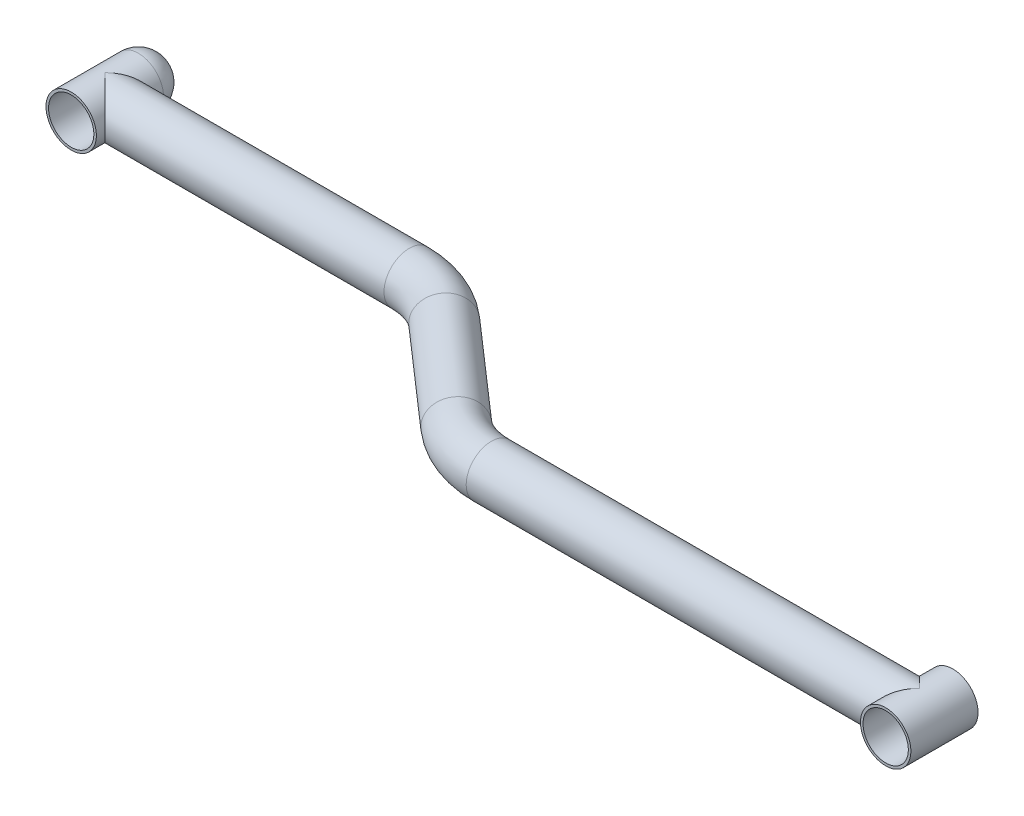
ISO-10303-21;
HEADER;
FILE_DESCRIPTION(('STEP AP214'),'2;1');
FILE_NAME('part.step','',(''),(''),'','','');
FILE_SCHEMA(('AUTOMOTIVE_DESIGN { 1 0 10303 214 1 1 1 1 }'));
ENDSEC;
DATA;
#1=APPLICATION_CONTEXT('core data for automotive mechanical design processes');
#2=APPLICATION_PROTOCOL_DEFINITION('international standard','automotive_design',2000,#1);
#3=PRODUCT_CONTEXT('',#1,'mechanical');
#4=PRODUCT('Part','Part','',(#3));
#5=PRODUCT_RELATED_PRODUCT_CATEGORY('part','',(#4));
#6=PRODUCT_DEFINITION_FORMATION('','',#4);
#7=PRODUCT_DEFINITION_CONTEXT('part definition',#1,'design');
#8=PRODUCT_DEFINITION('design','',#6,#7);
#9=PRODUCT_DEFINITION_SHAPE('','',#8);
#10=(LENGTH_UNIT() NAMED_UNIT(*) SI_UNIT(.MILLI.,.METRE.));
#11=(NAMED_UNIT(*) PLANE_ANGLE_UNIT() SI_UNIT($,.RADIAN.));
#12=(NAMED_UNIT(*) SI_UNIT($,.STERADIAN.) SOLID_ANGLE_UNIT());
#13=UNCERTAINTY_MEASURE_WITH_UNIT(LENGTH_MEASURE(1.E-05),#10,'distance_accuracy_value','');
#14=(GEOMETRIC_REPRESENTATION_CONTEXT(3) GLOBAL_UNCERTAINTY_ASSIGNED_CONTEXT((#13)) GLOBAL_UNIT_ASSIGNED_CONTEXT((#10,
#11,#12)) REPRESENTATION_CONTEXT('',''));
#15=CARTESIAN_POINT('',(0.,0.,0.));
#16=DIRECTION('',(0.,0.,1.));
#17=DIRECTION('',(1.,0.,0.));
#18=AXIS2_PLACEMENT_3D('',#15,#16,#17);
#19=CARTESIAN_POINT('',(-509.593998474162,0.,0.));
#20=DIRECTION('',(1.,0.,0.));
#21=DIRECTION('',(0.,0.,-0.999999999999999));
#22=AXIS2_PLACEMENT_3D('',#19,#20,#21);
#23=CYLINDRICAL_SURFACE('',#22,30.);
#24=CARTESIAN_POINT('',(-509.593998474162,0.,0.));
#25=DIRECTION('',(1.,0.,0.));
#26=DIRECTION('',(0.,0.,-0.999999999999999));
#27=AXIS2_PLACEMENT_3D('',#24,#25,#26);
#28=CIRCLE('',#27,30.);
#29=CARTESIAN_POINT('',(-509.593998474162,0.,30.0000000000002));
#30=VERTEX_POINT('',#29);
#31=EDGE_CURVE('E127',#30,#30,#28,.T.);
#32=ORIENTED_EDGE('',*,*,#31,.T.);
#33=EDGE_LOOP('',(#32));
#34=FACE_BOUND('',#33,.T.);
#35=CARTESIAN_POINT('',(0.,0.,0.));
#36=DIRECTION('',(0.707106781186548,0.,0.707106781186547));
#37=DIRECTION('',(0.707106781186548,0.,-0.707106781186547));
#38=AXIS2_PLACEMENT_3D('',#35,#36,#37);
#39=ELLIPSE('',#38,42.4264068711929,30.);
#40=CARTESIAN_POINT('',(0.,-30.,0.));
#41=VERTEX_POINT('',#40);
#42=CARTESIAN_POINT('',(0.,30.,0.));
#43=VERTEX_POINT('',#42);
#44=EDGE_CURVE('E91',#41,#43,#39,.F.);
#45=ORIENTED_EDGE('',*,*,#44,.T.);
#46=CARTESIAN_POINT('',(0.,0.,0.));
#47=DIRECTION('',(0.707106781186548,0.,-0.707106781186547));
#48=DIRECTION('',(0.707106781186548,0.,0.707106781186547));
#49=AXIS2_PLACEMENT_3D('',#46,#47,#48);
#50=ELLIPSE('',#49,42.4264068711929,30.);
#51=EDGE_CURVE('E73',#43,#41,#50,.F.);
#52=ORIENTED_EDGE('',*,*,#51,.T.);
#53=EDGE_LOOP('',(#45,#52));
#54=FACE_BOUND('',#53,.T.);
#55=ADVANCED_FACE('F49',(#34,#54),#23,.T.);
#56=CARTESIAN_POINT('',(-757.478702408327,0.,-150.));
#57=DIRECTION('',(-1.,0.,0.));
#58=DIRECTION('',(0.,0.,0.999999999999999));
#59=AXIS2_PLACEMENT_3D('',#56,#57,#58);
#60=CYLINDRICAL_SURFACE('',#59,30.);
#61=CARTESIAN_POINT('',(-757.478702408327,0.,-150.));
#62=DIRECTION('',(1.,0.,0.));
#63=DIRECTION('',(0.,0.,-0.999999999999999));
#64=AXIS2_PLACEMENT_3D('',#61,#62,#63);
#65=CIRCLE('',#64,30.);
#66=CARTESIAN_POINT('',(-757.478702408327,0.,-180.));
#67=VERTEX_POINT('',#66);
#68=EDGE_CURVE('E53',#67,#67,#65,.T.);
#69=ORIENTED_EDGE('',*,*,#68,.F.);
#70=EDGE_LOOP('',(#69));
#71=FACE_BOUND('',#70,.T.);
#72=CARTESIAN_POINT('',(-1120.,1.66533453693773E-13,-150.));
#73=DIRECTION('',(-0.707106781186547,0.,0.707106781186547));
#74=DIRECTION('',(-0.707106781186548,0.,-0.707106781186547));
#75=AXIS2_PLACEMENT_3D('',#72,#73,#74);
#76=ELLIPSE('',#75,42.4264068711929,30.);
#77=CARTESIAN_POINT('',(-1120.,30.,-150.));
#78=VERTEX_POINT('',#77);
#79=CARTESIAN_POINT('',(-1120.,-29.9999999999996,-150.));
#80=VERTEX_POINT('',#79);
#81=EDGE_CURVE('E78',#78,#80,#76,.F.);
#82=ORIENTED_EDGE('',*,*,#81,.T.);
#83=CARTESIAN_POINT('',(-1120.,1.66533453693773E-13,-150.));
#84=DIRECTION('',(-0.707106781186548,0.,-0.707106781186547));
#85=DIRECTION('',(-0.707106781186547,0.,0.707106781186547));
#86=AXIS2_PLACEMENT_3D('',#83,#84,#85);
#87=ELLIPSE('',#86,42.4264068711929,30.);
#88=EDGE_CURVE('E66',#80,#78,#87,.F.);
#89=ORIENTED_EDGE('',*,*,#88,.T.);
#90=EDGE_LOOP('',(#82,#89));
#91=FACE_BOUND('',#90,.T.);
#92=ADVANCED_FACE('F51',(#71,#91),#60,.T.);
#93=CARTESIAN_POINT('',(-757.478702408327,0.,-48.3898318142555));
#94=DIRECTION('',(0.,1.,0.));
#95=DIRECTION('',(0.,0.,0.999999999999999));
#96=AXIS2_PLACEMENT_3D('',#93,#94,#95);
#97=TOROIDAL_SURFACE('',#96,101.610168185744,30.);
#98=CARTESIAN_POINT('',(-690.60087780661,1.11022302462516E-13,-124.888085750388));
#99=DIRECTION('',(0.752860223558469,0.,0.658180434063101));
#100=DIRECTION('',(0.658180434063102,0.,-0.752860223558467));
#101=AXIS2_PLACEMENT_3D('',#98,#99,#100);
#102=CIRCLE('',#101,30.);
#103=CARTESIAN_POINT('',(-670.855464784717,1.27411750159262E-13,-147.473892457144));
#104=VERTEX_POINT('',#103);
#105=EDGE_CURVE('E311',#104,#104,#102,.T.);
#106=CARTESIAN_POINT('',(-757.478702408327,0.,-48.3898318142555));
#107=DIRECTION('',(0.,1.,0.));
#108=DIRECTION('',(0.,0.,0.999999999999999));
#109=AXIS2_PLACEMENT_3D('',#106,#107,#108);
#110=CIRCLE('',#109,131.610168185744);
#111=EDGE_CURVE('',#104,#67,#110,.T.);
#112=ORIENTED_EDGE('',*,*,#105,.F.);
#113=ORIENTED_EDGE('',*,*,#68,.T.);
#114=ORIENTED_EDGE('',*,*,#111,.T.);
#115=ORIENTED_EDGE('',*,*,#111,.F.);
#116=EDGE_LOOP('',(#112,#114,#113,#115));
#117=FACE_BOUND('',#116,.T.);
#118=ADVANCED_FACE('F122',(#117),#97,.T.);
#119=CARTESIAN_POINT('',(-576.47182307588,1.11022302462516E-13,-25.1119142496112));
#120=DIRECTION('',(-0.752860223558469,0.,-0.658180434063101));
#121=DIRECTION('',(-0.658180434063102,0.,0.752860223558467));
#122=AXIS2_PLACEMENT_3D('',#119,#120,#121);
#123=CYLINDRICAL_SURFACE('',#122,30.);
#124=CARTESIAN_POINT('',(-576.47182307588,1.11022302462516E-13,-25.1119142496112));
#125=DIRECTION('',(0.752860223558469,0.,0.658180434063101));
#126=DIRECTION('',(0.658180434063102,0.,-0.752860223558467));
#127=AXIS2_PLACEMENT_3D('',#124,#125,#126);
#128=CIRCLE('',#127,30.);
#129=CARTESIAN_POINT('',(-596.217236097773,1.60190645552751E-13,-2.52610754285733));
#130=VERTEX_POINT('',#129);
#131=EDGE_CURVE('E319',#130,#130,#128,.T.);
#132=ORIENTED_EDGE('',*,*,#131,.F.);
#133=EDGE_LOOP('',(#132));
#134=FACE_BOUND('',#133,.T.);
#135=ORIENTED_EDGE('',*,*,#105,.T.);
#136=EDGE_LOOP('',(#135));
#137=FACE_BOUND('',#136,.T.);
#138=ADVANCED_FACE('F140',(#134,#137),#123,.T.);
#139=CARTESIAN_POINT('',(-509.593998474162,0.,-101.610168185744));
#140=DIRECTION('',(0.,-1.,0.));
#141=DIRECTION('',(0.,0.,-0.999999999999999));
#142=AXIS2_PLACEMENT_3D('',#139,#140,#141);
#143=TOROIDAL_SURFACE('',#142,101.610168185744,30.);
#144=CARTESIAN_POINT('',(-509.593998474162,0.,-101.610168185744));
#145=DIRECTION('',(0.,-1.,0.));
#146=DIRECTION('',(0.,0.,-0.999999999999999));
#147=AXIS2_PLACEMENT_3D('',#144,#145,#146);
#148=CIRCLE('',#147,131.610168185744);
#149=EDGE_CURVE('',#30,#130,#148,.T.);
#150=ORIENTED_EDGE('',*,*,#31,.F.);
#151=ORIENTED_EDGE('',*,*,#131,.T.);
#152=ORIENTED_EDGE('',*,*,#149,.T.);
#153=ORIENTED_EDGE('',*,*,#149,.F.);
#154=EDGE_LOOP('',(#150,#152,#151,#153));
#155=FACE_BOUND('',#154,.T.);
#156=ADVANCED_FACE('F135',(#155),#143,.T.);
#157=CARTESIAN_POINT('',(0.,0.,-40.));
#158=DIRECTION('',(0.,0.,0.999999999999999));
#159=DIRECTION('',(1.,0.,0.));
#160=AXIS2_PLACEMENT_3D('',#157,#158,#159);
#161=PLANE('',#160);
#162=CARTESIAN_POINT('',(0.,0.,-40.));
#163=DIRECTION('',(0.,0.,0.999999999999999));
#164=DIRECTION('',(1.,0.,0.));
#165=AXIS2_PLACEMENT_3D('',#162,#163,#164);
#166=CIRCLE('',#165,27.);
#167=CARTESIAN_POINT('',(27.,0.,-40.));
#168=VERTEX_POINT('',#167);
#169=EDGE_CURVE('E145',#168,#168,#166,.T.);
#170=ORIENTED_EDGE('',*,*,#169,.T.);
#171=EDGE_LOOP('',(#170));
#172=FACE_BOUND('',#171,.T.);
#173=CARTESIAN_POINT('',(0.,0.,-40.));
#174=DIRECTION('',(0.,0.,-0.999999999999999));
#175=DIRECTION('',(-1.,0.,0.));
#176=AXIS2_PLACEMENT_3D('',#173,#174,#175);
#177=CIRCLE('',#176,30.);
#178=CARTESIAN_POINT('',(-30.,0.,-40.));
#179=VERTEX_POINT('',#178);
#180=EDGE_CURVE('E83',#179,#179,#177,.T.);
#181=ORIENTED_EDGE('',*,*,#180,.T.);
#182=EDGE_LOOP('',(#181));
#183=FACE_BOUND('',#182,.T.);
#184=ADVANCED_FACE('F112',(#172,#183),#161,.F.);
#185=CARTESIAN_POINT('',(0.,0.,-40.));
#186=DIRECTION('',(0.,0.,-0.999999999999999));
#187=DIRECTION('',(-1.,0.,0.));
#188=AXIS2_PLACEMENT_3D('',#185,#186,#187);
#189=CYLINDRICAL_SURFACE('',#188,30.);
#190=ORIENTED_EDGE('',*,*,#51,.F.);
#191=ORIENTED_EDGE('',*,*,#44,.F.);
#192=EDGE_LOOP('',(#190,#191));
#193=FACE_BOUND('',#192,.T.);
#194=ORIENTED_EDGE('',*,*,#180,.F.);
#195=EDGE_LOOP('',(#194));
#196=FACE_BOUND('',#195,.T.);
#197=CARTESIAN_POINT('',(0.,0.,40.));
#198=DIRECTION('',(0.,0.,-0.999999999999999));
#199=DIRECTION('',(-1.,0.,0.));
#200=AXIS2_PLACEMENT_3D('',#197,#198,#199);
#201=CIRCLE('',#200,30.);
#202=CARTESIAN_POINT('',(-30.,0.,40.));
#203=VERTEX_POINT('',#202);
#204=EDGE_CURVE('E86',#203,#203,#201,.T.);
#205=ORIENTED_EDGE('',*,*,#204,.T.);
#206=EDGE_LOOP('',(#205));
#207=FACE_BOUND('',#206,.T.);
#208=ADVANCED_FACE('F106',(#193,#196,#207),#189,.T.);
#209=CARTESIAN_POINT('',(0.,0.,40.));
#210=DIRECTION('',(0.,0.,-0.999999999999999));
#211=DIRECTION('',(-1.,0.,0.));
#212=AXIS2_PLACEMENT_3D('',#209,#210,#211);
#213=PLANE('',#212);
#214=CARTESIAN_POINT('',(0.,0.,40.));
#215=DIRECTION('',(0.,0.,0.999999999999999));
#216=DIRECTION('',(1.,0.,0.));
#217=AXIS2_PLACEMENT_3D('',#214,#215,#216);
#218=CIRCLE('',#217,27.);
#219=CARTESIAN_POINT('',(27.,0.,40.));
#220=VERTEX_POINT('',#219);
#221=EDGE_CURVE('E148',#220,#220,#218,.T.);
#222=ORIENTED_EDGE('',*,*,#221,.F.);
#223=EDGE_LOOP('',(#222));
#224=FACE_BOUND('',#223,.T.);
#225=ORIENTED_EDGE('',*,*,#204,.F.);
#226=EDGE_LOOP('',(#225));
#227=FACE_BOUND('',#226,.T.);
#228=ADVANCED_FACE('F111',(#224,#227),#213,.F.);
#229=CARTESIAN_POINT('',(-1120.,1.66533453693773E-13,-190.));
#230=DIRECTION('',(0.,0.,-0.999999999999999));
#231=DIRECTION('',(-1.,0.,0.));
#232=AXIS2_PLACEMENT_3D('',#229,#230,#231);
#233=CYLINDRICAL_SURFACE('',#232,30.);
#234=CARTESIAN_POINT('',(-1120.,1.66533453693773E-13,-110.));
#235=DIRECTION('',(0.,0.,-0.999999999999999));
#236=DIRECTION('',(-1.,0.,0.));
#237=AXIS2_PLACEMENT_3D('',#234,#235,#236);
#238=CIRCLE('',#237,30.);
#239=CARTESIAN_POINT('',(-1150.,1.68198788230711E-13,-110.));
#240=VERTEX_POINT('',#239);
#241=EDGE_CURVE('E81',#240,#240,#238,.T.);
#242=ORIENTED_EDGE('',*,*,#241,.T.);
#243=EDGE_LOOP('',(#242));
#244=FACE_BOUND('',#243,.T.);
#245=CARTESIAN_POINT('',(-1120.,1.66533453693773E-13,-190.));
#246=DIRECTION('',(0.,0.,-0.999999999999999));
#247=DIRECTION('',(-1.,0.,0.));
#248=AXIS2_PLACEMENT_3D('',#245,#246,#247);
#249=CIRCLE('',#248,30.);
#250=CARTESIAN_POINT('',(-1150.,1.68198788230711E-13,-190.));
#251=VERTEX_POINT('',#250);
#252=EDGE_CURVE('E147',#251,#251,#249,.T.);
#253=ORIENTED_EDGE('',*,*,#252,.F.);
#254=EDGE_LOOP('',(#253));
#255=FACE_BOUND('',#254,.T.);
#256=ORIENTED_EDGE('',*,*,#88,.F.);
#257=ORIENTED_EDGE('',*,*,#81,.F.);
#258=EDGE_LOOP('',(#256,#257));
#259=FACE_BOUND('',#258,.T.);
#260=ADVANCED_FACE('F79',(#244,#255,#259),#233,.T.);
#261=CARTESIAN_POINT('',(-1120.,1.66533453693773E-13,-110.));
#262=DIRECTION('',(0.,0.,0.999999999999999));
#263=DIRECTION('',(1.,0.,0.));
#264=AXIS2_PLACEMENT_3D('',#261,#262,#263);
#265=PLANE('',#264);
#266=CARTESIAN_POINT('',(-1120.,1.66533453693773E-13,-110.));
#267=DIRECTION('',(0.,0.,0.999999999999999));
#268=DIRECTION('',(1.,0.,0.));
#269=AXIS2_PLACEMENT_3D('',#266,#267,#268);
#270=CIRCLE('',#269,27.0000000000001);
#271=CARTESIAN_POINT('',(-1093.,1.65034652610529E-13,-110.));
#272=VERTEX_POINT('',#271);
#273=EDGE_CURVE('E185',#272,#272,#270,.T.);
#274=ORIENTED_EDGE('',*,*,#273,.F.);
#275=EDGE_LOOP('',(#274));
#276=FACE_BOUND('',#275,.T.);
#277=ORIENTED_EDGE('',*,*,#241,.F.);
#278=EDGE_LOOP('',(#277));
#279=FACE_BOUND('',#278,.T.);
#280=ADVANCED_FACE('F172',(#276,#279),#265,.T.);
#281=CARTESIAN_POINT('',(0.,0.,-189.999999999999));
#282=DIRECTION('',(0.,0.,0.999999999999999));
#283=DIRECTION('',(1.,0.,0.));
#284=AXIS2_PLACEMENT_3D('',#281,#282,#283);
#285=CYLINDRICAL_SURFACE('',#284,27.);
#286=CARTESIAN_POINT('',(27.,0.,40.));
#287=CARTESIAN_POINT('',(27.,0.,39.1666666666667));
#288=CARTESIAN_POINT('',(27.,0.,38.3333333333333));
#289=CARTESIAN_POINT('',(27.,0.,36.6666666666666));
#290=CARTESIAN_POINT('',(27.,0.,35.8333333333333));
#291=CARTESIAN_POINT('',(27.,0.,34.1666666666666));
#292=CARTESIAN_POINT('',(27.,0.,33.3333333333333));
#293=CARTESIAN_POINT('',(27.,0.,31.6666666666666));
#294=CARTESIAN_POINT('',(27.,0.,30.8333333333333));
#295=CARTESIAN_POINT('',(27.,0.,29.1666666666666));
#296=CARTESIAN_POINT('',(27.,0.,28.3333333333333));
#297=CARTESIAN_POINT('',(27.,0.,26.6666666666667));
#298=CARTESIAN_POINT('',(27.,0.,25.8333333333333));
#299=CARTESIAN_POINT('',(27.,0.,24.1666666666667));
#300=CARTESIAN_POINT('',(27.,0.,23.3333333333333));
#301=CARTESIAN_POINT('',(27.,0.,21.6666666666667));
#302=CARTESIAN_POINT('',(27.,0.,20.8333333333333));
#303=CARTESIAN_POINT('',(27.,0.,19.1666666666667));
#304=CARTESIAN_POINT('',(27.,0.,18.3333333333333));
#305=CARTESIAN_POINT('',(27.,0.,16.6666666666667));
#306=CARTESIAN_POINT('',(27.,0.,15.8333333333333));
#307=CARTESIAN_POINT('',(27.,0.,14.1666666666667));
#308=CARTESIAN_POINT('',(27.,0.,13.3333333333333));
#309=CARTESIAN_POINT('',(27.,0.,11.6666666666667));
#310=CARTESIAN_POINT('',(27.,0.,10.8333333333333));
#311=CARTESIAN_POINT('',(27.,0.,9.16666666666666));
#312=CARTESIAN_POINT('',(27.,0.,8.33333333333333));
#313=CARTESIAN_POINT('',(27.,0.,6.66666666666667));
#314=CARTESIAN_POINT('',(27.,0.,5.83333333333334));
#315=CARTESIAN_POINT('',(27.,0.,4.16666666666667));
#316=CARTESIAN_POINT('',(27.,0.,3.33333333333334));
#317=CARTESIAN_POINT('',(27.,0.,1.66666666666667));
#318=CARTESIAN_POINT('',(27.,0.,0.833333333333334));
#319=CARTESIAN_POINT('',(27.,0.,-0.833333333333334));
#320=CARTESIAN_POINT('',(27.,0.,-1.66666666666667));
#321=CARTESIAN_POINT('',(27.,0.,-3.33333333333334));
#322=CARTESIAN_POINT('',(27.,0.,-4.16666666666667));
#323=CARTESIAN_POINT('',(27.,0.,-5.83333333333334));
#324=CARTESIAN_POINT('',(27.,0.,-6.66666666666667));
#325=CARTESIAN_POINT('',(27.,0.,-8.33333333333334));
#326=CARTESIAN_POINT('',(27.,0.,-9.16666666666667));
#327=CARTESIAN_POINT('',(27.,0.,-10.8333333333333));
#328=CARTESIAN_POINT('',(27.,0.,-11.6666666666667));
#329=CARTESIAN_POINT('',(27.,0.,-13.3333333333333));
#330=CARTESIAN_POINT('',(27.,0.,-14.1666666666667));
#331=CARTESIAN_POINT('',(27.,0.,-15.8333333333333));
#332=CARTESIAN_POINT('',(27.,0.,-16.6666666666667));
#333=CARTESIAN_POINT('',(27.,0.,-18.3333333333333));
#334=CARTESIAN_POINT('',(27.,0.,-19.1666666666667));
#335=CARTESIAN_POINT('',(27.,0.,-20.8333333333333));
#336=CARTESIAN_POINT('',(27.,0.,-21.6666666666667));
#337=CARTESIAN_POINT('',(27.,0.,-23.3333333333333));
#338=CARTESIAN_POINT('',(27.,0.,-24.1666666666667));
#339=CARTESIAN_POINT('',(27.,0.,-25.8333333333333));
#340=CARTESIAN_POINT('',(27.,0.,-26.6666666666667));
#341=CARTESIAN_POINT('',(27.,0.,-28.3333333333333));
#342=CARTESIAN_POINT('',(27.,0.,-29.1666666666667));
#343=CARTESIAN_POINT('',(27.,0.,-30.8333333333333));
#344=CARTESIAN_POINT('',(27.,0.,-31.6666666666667));
#345=CARTESIAN_POINT('',(27.,0.,-33.3333333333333));
#346=CARTESIAN_POINT('',(27.,0.,-34.1666666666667));
#347=CARTESIAN_POINT('',(27.,0.,-35.8333333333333));
#348=CARTESIAN_POINT('',(27.,0.,-36.6666666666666));
#349=CARTESIAN_POINT('',(27.,0.,-38.3333333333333));
#350=CARTESIAN_POINT('',(27.,0.,-39.1666666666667));
#351=CARTESIAN_POINT('',(27.,0.,-40.));
#352=B_SPLINE_CURVE_WITH_KNOTS('',3,(#286,#287,#288,#289,#290,#291,#292,#293,#294,#295,#296,
#297,#298,#299,#300,#301,#302,#303,#304,#305,#306,#307,#308,#309,#310,#311,#312,#313,#314,#315,
#316,#317,#318,#319,#320,#321,#322,#323,#324,#325,#326,#327,#328,#329,#330,#331,#332,#333,#334,
#335,#336,#337,#338,#339,#340,#341,#342,#343,#344,#345,#346,#347,#348,#349,#350,#351),
.UNSPECIFIED.,.F.,.F.,(4,2,2,2,2,2,2,2,2,2,2,2,2,2,2,2,2,2,2,2,2,2,2,2,2,2,2,2,2,2,2,2,4),(0.,
2.5,5.,7.50000000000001,10.,12.5,15.,17.5,20.,22.5,25.,27.5,30.,32.5,35.,37.5,40.,42.5,45.,47.5,
50.,52.5,55.,57.5,60.,62.5,65.,67.5,70.,72.5,75.,77.5,80.),.UNSPECIFIED.);
#353=EDGE_CURVE('BSEAM170',#220,#168,#352,.T.);
#354=ORIENTED_EDGE('',*,*,#221,.T.);
#355=ORIENTED_EDGE('',*,*,#169,.F.);
#356=ORIENTED_EDGE('',*,*,#353,.T.);
#357=ORIENTED_EDGE('',*,*,#353,.F.);
#358=EDGE_LOOP('',(#354,#356,#355,#357));
#359=FACE_BOUND('',#358,.T.);
#360=ADVANCED_FACE('F170',(#359),#285,.F.);
#361=CARTESIAN_POINT('',(-1120.,1.66533453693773E-13,-190.));
#362=DIRECTION('',(0.,0.,0.999999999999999));
#363=DIRECTION('',(1.,0.,0.));
#364=AXIS2_PLACEMENT_3D('',#361,#362,#363);
#365=CYLINDRICAL_SURFACE('',#364,27.0000000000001);
#366=CARTESIAN_POINT('',(-1120.,1.66533453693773E-13,-190.));
#367=DIRECTION('',(0.,0.,0.999999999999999));
#368=DIRECTION('',(1.,0.,0.));
#369=AXIS2_PLACEMENT_3D('',#366,#367,#368);
#370=CIRCLE('',#369,27.0000000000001);
#371=CARTESIAN_POINT('',(-1093.,1.6503465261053E-13,-190.));
#372=VERTEX_POINT('',#371);
#373=EDGE_CURVE('E153',#372,#372,#370,.T.);
#374=CARTESIAN_POINT('',(-1093.,1.6503465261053E-13,-190.));
#375=CARTESIAN_POINT('',(-1093.,1.6503465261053E-13,-189.166666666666));
#376=CARTESIAN_POINT('',(-1093.,1.6503465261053E-13,-188.333333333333));
#377=CARTESIAN_POINT('',(-1093.,1.6503465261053E-13,-186.666666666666));
#378=CARTESIAN_POINT('',(-1093.,1.6503465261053E-13,-185.833333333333));
#379=CARTESIAN_POINT('',(-1093.,1.6503465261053E-13,-184.166666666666));
#380=CARTESIAN_POINT('',(-1093.,1.6503465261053E-13,-183.333333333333));
#381=CARTESIAN_POINT('',(-1093.,1.6503465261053E-13,-181.666666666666));
#382=CARTESIAN_POINT('',(-1093.,1.6503465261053E-13,-180.833333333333));
#383=CARTESIAN_POINT('',(-1093.,1.6503465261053E-13,-179.166666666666));
#384=CARTESIAN_POINT('',(-1093.,1.6503465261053E-13,-178.333333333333));
#385=CARTESIAN_POINT('',(-1093.,1.6503465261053E-13,-176.666666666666));
#386=CARTESIAN_POINT('',(-1093.,1.6503465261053E-13,-175.833333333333));
#387=CARTESIAN_POINT('',(-1093.,1.6503465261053E-13,-174.166666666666));
#388=CARTESIAN_POINT('',(-1093.,1.6503465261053E-13,-173.333333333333));
#389=CARTESIAN_POINT('',(-1093.,1.6503465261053E-13,-171.666666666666));
#390=CARTESIAN_POINT('',(-1093.,1.6503465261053E-13,-170.833333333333));
#391=CARTESIAN_POINT('',(-1093.,1.6503465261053E-13,-169.166666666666));
#392=CARTESIAN_POINT('',(-1093.,1.6503465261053E-13,-168.333333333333));
#393=CARTESIAN_POINT('',(-1093.,1.6503465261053E-13,-166.666666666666));
#394=CARTESIAN_POINT('',(-1093.,1.6503465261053E-13,-165.833333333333));
#395=CARTESIAN_POINT('',(-1093.,1.6503465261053E-13,-164.166666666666));
#396=CARTESIAN_POINT('',(-1093.,1.6503465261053E-13,-163.333333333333));
#397=CARTESIAN_POINT('',(-1093.,1.6503465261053E-13,-161.666666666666));
#398=CARTESIAN_POINT('',(-1093.,1.6503465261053E-13,-160.833333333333));
#399=CARTESIAN_POINT('',(-1093.,1.6503465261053E-13,-159.166666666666));
#400=CARTESIAN_POINT('',(-1093.,1.6503465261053E-13,-158.333333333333));
#401=CARTESIAN_POINT('',(-1093.,1.6503465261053E-13,-156.666666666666));
#402=CARTESIAN_POINT('',(-1093.,1.6503465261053E-13,-155.833333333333));
#403=CARTESIAN_POINT('',(-1093.,1.6503465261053E-13,-154.166666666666));
#404=CARTESIAN_POINT('',(-1093.,1.6503465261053E-13,-153.333333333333));
#405=CARTESIAN_POINT('',(-1093.,1.6503465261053E-13,-151.666666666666));
#406=CARTESIAN_POINT('',(-1093.,1.6503465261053E-13,-150.833333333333));
#407=CARTESIAN_POINT('',(-1093.,1.6503465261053E-13,-149.166666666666));
#408=CARTESIAN_POINT('',(-1093.,1.6503465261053E-13,-148.333333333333));
#409=CARTESIAN_POINT('',(-1093.,1.6503465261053E-13,-146.666666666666));
#410=CARTESIAN_POINT('',(-1093.,1.6503465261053E-13,-145.833333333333));
#411=CARTESIAN_POINT('',(-1093.,1.6503465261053E-13,-144.166666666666));
#412=CARTESIAN_POINT('',(-1093.,1.6503465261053E-13,-143.333333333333));
#413=CARTESIAN_POINT('',(-1093.,1.6503465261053E-13,-141.666666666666));
#414=CARTESIAN_POINT('',(-1093.,1.6503465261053E-13,-140.833333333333));
#415=CARTESIAN_POINT('',(-1093.,1.6503465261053E-13,-139.166666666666));
#416=CARTESIAN_POINT('',(-1093.,1.6503465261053E-13,-138.333333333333));
#417=CARTESIAN_POINT('',(-1093.,1.6503465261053E-13,-136.666666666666));
#418=CARTESIAN_POINT('',(-1093.,1.6503465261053E-13,-135.833333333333));
#419=CARTESIAN_POINT('',(-1093.,1.6503465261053E-13,-134.166666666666));
#420=CARTESIAN_POINT('',(-1093.,1.6503465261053E-13,-133.333333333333));
#421=CARTESIAN_POINT('',(-1093.,1.6503465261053E-13,-131.666666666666));
#422=CARTESIAN_POINT('',(-1093.,1.6503465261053E-13,-130.833333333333));
#423=CARTESIAN_POINT('',(-1093.,1.6503465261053E-13,-129.166666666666));
#424=CARTESIAN_POINT('',(-1093.,1.6503465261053E-13,-128.333333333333));
#425=CARTESIAN_POINT('',(-1093.,1.6503465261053E-13,-126.666666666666));
#426=CARTESIAN_POINT('',(-1093.,1.6503465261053E-13,-125.833333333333));
#427=CARTESIAN_POINT('',(-1093.,1.6503465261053E-13,-124.166666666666));
#428=CARTESIAN_POINT('',(-1093.,1.6503465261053E-13,-123.333333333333));
#429=CARTESIAN_POINT('',(-1093.,1.6503465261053E-13,-121.666666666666));
#430=CARTESIAN_POINT('',(-1093.,1.6503465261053E-13,-120.833333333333));
#431=CARTESIAN_POINT('',(-1093.,1.6503465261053E-13,-119.166666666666));
#432=CARTESIAN_POINT('',(-1093.,1.65034652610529E-13,-118.333333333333));
#433=CARTESIAN_POINT('',(-1093.,1.65034652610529E-13,-116.666666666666));
#434=CARTESIAN_POINT('',(-1093.,1.65034652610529E-13,-115.833333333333));
#435=CARTESIAN_POINT('',(-1093.,1.65034652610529E-13,-114.166666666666));
#436=CARTESIAN_POINT('',(-1093.,1.65034652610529E-13,-113.333333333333));
#437=CARTESIAN_POINT('',(-1093.,1.65034652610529E-13,-111.666666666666));
#438=CARTESIAN_POINT('',(-1093.,1.65034652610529E-13,-110.833333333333));
#439=CARTESIAN_POINT('',(-1093.,1.65034652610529E-13,-110.));
#440=B_SPLINE_CURVE_WITH_KNOTS('',3,(#374,#375,#376,#377,#378,#379,#380,#381,#382,#383,#384,
#385,#386,#387,#388,#389,#390,#391,#392,#393,#394,#395,#396,#397,#398,#399,#400,#401,#402,#403,
#404,#405,#406,#407,#408,#409,#410,#411,#412,#413,#414,#415,#416,#417,#418,#419,#420,#421,#422,
#423,#424,#425,#426,#427,#428,#429,#430,#431,#432,#433,#434,#435,#436,#437,#438,#439),
.UNSPECIFIED.,.F.,.F.,(4,2,2,2,2,2,2,2,2,2,2,2,2,2,2,2,2,2,2,2,2,2,2,2,2,2,2,2,2,2,2,2,4),(0.,
2.49999999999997,4.99999999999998,7.49999999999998,9.99999999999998,12.5,15.,17.5,20.,22.5,25.,
27.5,30.,32.5,35.,37.5,40.,42.5,44.9999999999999,47.4999999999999,49.9999999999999,
52.4999999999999,54.9999999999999,57.4999999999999,59.9999999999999,62.4999999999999,
64.9999999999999,67.4999999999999,69.9999999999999,72.4999999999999,74.9999999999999,
77.4999999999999,79.9999999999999),.UNSPECIFIED.);
#441=EDGE_CURVE('BSEAM179',#372,#272,#440,.T.);
#442=ORIENTED_EDGE('',*,*,#373,.F.);
#443=ORIENTED_EDGE('',*,*,#273,.T.);
#444=ORIENTED_EDGE('',*,*,#441,.T.);
#445=ORIENTED_EDGE('',*,*,#441,.F.);
#446=EDGE_LOOP('',(#442,#444,#443,#445));
#447=FACE_BOUND('',#446,.T.);
#448=ADVANCED_FACE('F179',(#447),#365,.F.);
#449=CARTESIAN_POINT('',(-1120.,1.66533453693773E-13,-190.));
#450=DIRECTION('',(0.,0.,-0.999999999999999));
#451=DIRECTION('',(-1.,0.,0.));
#452=AXIS2_PLACEMENT_3D('',#449,#450,#451);
#453=PLANE('',#452);
#454=ORIENTED_EDGE('',*,*,#373,.T.);
#455=EDGE_LOOP('',(#454));
#456=FACE_BOUND('',#455,.T.);
#457=ADVANCED_FACE('F192',(#456),#453,.F.);
#458=CARTESIAN_POINT('',(-1120.,1.66533453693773E-13,-190.));
#459=DIRECTION('',(0.,0.,0.999999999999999));
#460=DIRECTION('',(1.,0.,0.));
#461=AXIS2_PLACEMENT_3D('',#458,#459,#460);
#462=SPHERICAL_SURFACE('',#461,30.);
#463=ORIENTED_EDGE('',*,*,#252,.T.);
#464=EDGE_LOOP('',(#463));
#465=FACE_BOUND('',#464,.T.);
#466=ADVANCED_FACE('F190',(#465),#462,.T.);
#467=CLOSED_SHELL('',(#55,#92,#118,#138,#156,#184,#208,#228,#260,#280,#360,#448,#457,#466));
#468=CARTESIAN_POINT('',(-1090.,0.,-123.));
#469=CARTESIAN_POINT('',(-1090.00000533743,-0.625774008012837,-123.000005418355));
#470=CARTESIAN_POINT('',(-1090.01962260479,-1.25163798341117,-123.021797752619));
#471=CARTESIAN_POINT('',(-1090.09765586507,-2.49798362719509,-123.108541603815));
#472=CARTESIAN_POINT('',(-1090.15607939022,-3.1184642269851,-123.173501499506));
#473=CARTESIAN_POINT('',(-1090.3104697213,-4.34934840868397,-123.345363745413));
#474=CARTESIAN_POINT('',(-1090.40646713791,-4.95974335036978,-123.45230029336));
#475=CARTESIAN_POINT('',(-1090.63395036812,-6.16534685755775,-123.706121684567));
#476=CARTESIAN_POINT('',(-1090.76543531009,-6.76055579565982,-123.853005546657));
#477=CARTESIAN_POINT('',(-1091.06033770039,-7.9281925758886,-124.183154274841));
#478=CARTESIAN_POINT('',(-1091.22354208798,-8.50074332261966,-124.366176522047));
#479=CARTESIAN_POINT('',(-1091.57954202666,-9.62417911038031,-124.766474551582));
#480=CARTESIAN_POINT('',(-1091.77233712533,-10.1750644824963,-124.983749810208));
#481=CARTESIAN_POINT('',(-1092.18450422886,-11.2530565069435,-125.449773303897));
#482=CARTESIAN_POINT('',(-1092.40387901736,-11.7801606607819,-125.69852483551));
#483=CARTESIAN_POINT('',(-1092.86619841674,-12.8091780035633,-126.224823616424));
#484=CARTESIAN_POINT('',(-1093.10914831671,-13.3110855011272,-126.502377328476));
#485=CARTESIAN_POINT('',(-1093.53917420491,-14.1411644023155,-126.995973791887));
#486=CARTESIAN_POINT('',(-1093.72100534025,-14.4760839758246,-127.205324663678));
#487=CARTESIAN_POINT('',(-1094.09364858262,-15.1328615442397,-127.635951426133));
#488=CARTESIAN_POINT('',(-1094.28445880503,-15.4547222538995,-127.857224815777));
#489=CARTESIAN_POINT('',(-1094.8691428,-16.4009074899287,-128.538074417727));
#490=CARTESIAN_POINT('',(-1095.27519419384,-17.0056904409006,-129.014593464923));
#491=CARTESIAN_POINT('',(-1096.11305573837,-18.1638668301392,-130.008556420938));
#492=CARTESIAN_POINT('',(-1096.54491894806,-18.7171479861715,-130.526085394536));
#493=CARTESIAN_POINT('',(-1097.42656741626,-19.7714988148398,-131.597483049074));
#494=CARTESIAN_POINT('',(-1097.87635032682,-20.2725752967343,-132.15134697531));
#495=CARTESIAN_POINT('',(-1098.79734985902,-21.2344359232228,-133.306384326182));
#496=CARTESIAN_POINT('',(-1099.26882170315,-21.6940092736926,-133.908359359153));
#497=CARTESIAN_POINT('',(-1100.21504563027,-22.56028987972,-135.147222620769));
#498=CARTESIAN_POINT('',(-1100.68979856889,-22.9669827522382,-135.784120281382));
#499=CARTESIAN_POINT('',(-1101.39623029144,-23.5370203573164,-136.765527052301));
#500=CARTESIAN_POINT('',(-1101.6305732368,-23.7202356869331,-137.096731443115));
#501=CARTESIAN_POINT('',(-1102.09596810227,-24.0734479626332,-137.768356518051));
#502=CARTESIAN_POINT('',(-1102.32702032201,-24.2434461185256,-138.108776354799));
#503=CARTESIAN_POINT('',(-1102.78394168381,-24.5700256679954,-138.799126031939));
#504=CARTESIAN_POINT('',(-1103.0098132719,-24.7266134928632,-139.149051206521));
#505=CARTESIAN_POINT('',(-1103.45428912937,-25.0262112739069,-139.85913067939));
#506=CARTESIAN_POINT('',(-1103.67289440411,-25.1692231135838,-140.219283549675));
#507=CARTESIAN_POINT('',(-1104.09948812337,-25.44086158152,-140.949377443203));
#508=CARTESIAN_POINT('',(-1104.30750956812,-25.569534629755,-141.319281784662));
#509=CARTESIAN_POINT('',(-1104.71042346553,-25.8124809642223,-142.070827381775));
#510=CARTESIAN_POINT('',(-1104.90531638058,-25.9267547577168,-142.452468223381));
#511=CARTESIAN_POINT('',(-1105.27777420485,-26.1400476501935,-143.228031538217));
#512=CARTESIAN_POINT('',(-1105.45534978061,-26.2390761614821,-143.621946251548));
#513=CARTESIAN_POINT('',(-1105.78828224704,-26.4208830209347,-144.422774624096));
#514=CARTESIAN_POINT('',(-1105.94364253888,-26.5036638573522,-144.829686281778));
#515=CARTESIAN_POINT('',(-1106.20235974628,-26.6391204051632,-145.586497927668));
#516=CARTESIAN_POINT('',(-1106.3100680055,-26.6945195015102,-145.934414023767));
#517=CARTESIAN_POINT('',(-1106.50236255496,-26.7922645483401,-146.638343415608));
#518=CARTESIAN_POINT('',(-1106.58695631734,-26.8346147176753,-146.994354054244));
#519=CARTESIAN_POINT('',(-1106.72935122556,-26.9053197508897,-147.712306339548));
#520=CARTESIAN_POINT('',(-1106.78721158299,-26.9337055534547,-148.074233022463));
#521=CARTESIAN_POINT('',(-1106.87355711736,-26.9758937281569,-148.80245058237));
#522=CARTESIAN_POINT('',(-1106.90204410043,-26.9896969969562,-149.168741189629));
#523=CARTESIAN_POINT('',(-1106.92815472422,-27.0023534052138,-149.904707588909));
#524=CARTESIAN_POINT('',(-1106.92560866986,-27.0011243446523,-150.274390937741));
#525=CARTESIAN_POINT('',(-1106.88938784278,-26.9835548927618,-151.011846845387));
#526=CARTESIAN_POINT('',(-1106.85571241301,-26.9672141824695,-151.379619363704));
#527=CARTESIAN_POINT('',(-1106.75898518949,-26.9198512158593,-152.110965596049));
#528=CARTESIAN_POINT('',(-1106.69587869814,-26.8888016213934,-152.474530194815));
#529=CARTESIAN_POINT('',(-1106.54335217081,-26.8127927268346,-153.194575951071));
#530=CARTESIAN_POINT('',(-1106.45392765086,-26.7678310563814,-153.551055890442));
#531=CARTESIAN_POINT('',(-1106.20924957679,-26.6428459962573,-154.406507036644));
#532=CARTESIAN_POINT('',(-1106.04220547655,-26.5560534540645,-154.901115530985));
#533=CARTESIAN_POINT('',(-1105.67252492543,-26.3584391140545,-155.871835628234));
#534=CARTESIAN_POINT('',(-1105.46986833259,-26.2476037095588,-156.347936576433));
#535=CARTESIAN_POINT('',(-1105.03740816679,-26.0035136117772,-157.283671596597));
#536=CARTESIAN_POINT('',(-1104.80751203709,-25.8701817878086,-157.743242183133));
#537=CARTESIAN_POINT('',(-1104.32847297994,-25.5828315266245,-158.645394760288));
#538=CARTESIAN_POINT('',(-1104.07933158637,-25.4288147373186,-159.087978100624));
#539=CARTESIAN_POINT('',(-1103.58639496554,-25.1132000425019,-159.925331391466));
#540=CARTESIAN_POINT('',(-1103.34357400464,-24.9530119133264,-160.321212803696));
#541=CARTESIAN_POINT('',(-1102.84965895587,-24.6161569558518,-161.10068014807));
#542=CARTESIAN_POINT('',(-1102.59856355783,-24.4394875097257,-161.48426411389));
#543=CARTESIAN_POINT('',(-1102.09075150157,-24.0698469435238,-162.240079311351));
#544=CARTESIAN_POINT('',(-1101.83403126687,-23.8768652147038,-162.612302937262));
#545=CARTESIAN_POINT('',(-1101.31741585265,-23.4748417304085,-163.345660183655));
#546=CARTESIAN_POINT('',(-1101.05752084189,-23.2658008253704,-163.706794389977));
#547=CARTESIAN_POINT('',(-1100.5364583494,-22.8316781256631,-164.41832666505));
#548=CARTESIAN_POINT('',(-1100.27529091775,-22.6065969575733,-164.768725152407));
#549=CARTESIAN_POINT('',(-1099.7533225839,-22.1403388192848,-165.458939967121));
#550=CARTESIAN_POINT('',(-1099.49252171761,-21.8991603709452,-165.798755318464));
#551=CARTESIAN_POINT('',(-1098.71317330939,-21.1515661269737,-166.801995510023));
#552=CARTESIAN_POINT('',(-1098.19733059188,-20.6208039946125,-167.449685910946));
#553=CARTESIAN_POINT('',(-1097.25641569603,-19.5742568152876,-168.610980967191));
#554=CARTESIAN_POINT('',(-1096.82891687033,-19.0671958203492,-169.130510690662));
#555=CARTESIAN_POINT('',(-1095.99352311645,-18.0040576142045,-170.134259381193));
#556=CARTESIAN_POINT('',(-1095.58562938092,-17.4479774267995,-170.618476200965));
#557=CARTESIAN_POINT('',(-1094.796604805,-16.2874241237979,-171.546944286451));
#558=CARTESIAN_POINT('',(-1094.41542822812,-15.6830376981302,-171.991264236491));
#559=CARTESIAN_POINT('',(-1093.86843354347,-14.7401931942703,-172.624544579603));
#560=CARTESIAN_POINT('',(-1093.69024294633,-14.4198932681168,-172.830090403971));
#561=CARTESIAN_POINT('',(-1093.34289934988,-13.7671957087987,-173.22952330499));
#562=CARTESIAN_POINT('',(-1093.17374861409,-13.4347950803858,-173.423407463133));
#563=CARTESIAN_POINT('',(-1092.75663507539,-12.5751623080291,-173.900221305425));
#564=CARTESIAN_POINT('',(-1092.51552385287,-12.0397847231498,-174.174599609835));
#565=CARTESIAN_POINT('',(-1092.06052398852,-10.9425025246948,-174.690668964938));
#566=CARTESIAN_POINT('',(-1091.84662898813,-10.3806041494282,-174.932367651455));
#567=CARTESIAN_POINT('',(-1091.44947492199,-9.2323550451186,-175.379975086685));
#568=CARTESIAN_POINT('',(-1091.26620755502,-8.64601099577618,-175.585893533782));
#569=CARTESIAN_POINT('',(-1090.93357640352,-7.45166043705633,-175.958892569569));
#570=CARTESIAN_POINT('',(-1090.78421307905,-6.84365363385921,-176.125972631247));
#571=CARTESIAN_POINT('',(-1090.52143480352,-5.60516361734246,-176.419502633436));
#572=CARTESIAN_POINT('',(-1090.4083002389,-4.97454520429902,-176.545635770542));
#573=CARTESIAN_POINT('',(-1090.22208955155,-3.70009505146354,-176.753056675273));
#574=CARTESIAN_POINT('',(-1090.14901352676,-3.05626327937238,-176.834344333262));
#575=CARTESIAN_POINT('',(-1090.04471059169,-1.7613466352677,-176.950324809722));
#576=CARTESIAN_POINT('',(-1090.01346335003,-1.11026544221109,-176.985040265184));
#577=CARTESIAN_POINT('',(-1089.99354366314,0.193318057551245,-177.007174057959));
#578=CARTESIAN_POINT('',(-1090.00486691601,0.845820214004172,-176.994597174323));
#579=CARTESIAN_POINT('',(-1090.06594916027,2.06943823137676,-176.92670746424));
#580=CARTESIAN_POINT('',(-1090.11102538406,2.64109041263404,-176.876601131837));
#581=CARTESIAN_POINT('',(-1090.23318659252,3.77661597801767,-176.740681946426));
#582=CARTESIAN_POINT('',(-1090.3102685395,4.34049009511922,-176.654872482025));
#583=CARTESIAN_POINT('',(-1090.49503174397,5.45683227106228,-176.448917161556));
#584=CARTESIAN_POINT('',(-1090.60271495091,6.00929960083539,-176.328769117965));
#585=CARTESIAN_POINT('',(-1090.84682961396,7.09963507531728,-176.055921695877));
#586=CARTESIAN_POINT('',(-1090.98326261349,7.63750243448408,-175.903220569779));
#587=CARTESIAN_POINT('',(-1091.28638603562,8.70895637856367,-175.563209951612));
#588=CARTESIAN_POINT('',(-1091.45373567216,9.24211548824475,-175.375144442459));
#589=CARTESIAN_POINT('',(-1091.81382281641,10.2881195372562,-174.969367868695));
#590=CARTESIAN_POINT('',(-1092.00655996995,10.8009647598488,-174.75165721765));
#591=CARTESIAN_POINT('',(-1092.41486938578,11.8048416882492,-174.288912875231));
#592=CARTESIAN_POINT('',(-1092.63044611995,12.2958690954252,-174.043873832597));
#593=CARTESIAN_POINT('',(-1093.08187803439,13.2550262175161,-173.528720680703));
#594=CARTESIAN_POINT('',(-1093.31773747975,13.723151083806,-173.258601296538));
#595=CARTESIAN_POINT('',(-1093.74585158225,14.5213739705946,-172.766009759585));
#596=CARTESIAN_POINT('',(-1093.93423078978,14.8566750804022,-172.54854992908));
#597=CARTESIAN_POINT('',(-1094.31987893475,15.5137519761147,-172.101614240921));
#598=CARTESIAN_POINT('',(-1094.51714635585,15.8355300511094,-171.872140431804));
#599=CARTESIAN_POINT('',(-1095.12102961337,16.7808218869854,-171.166543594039));
#600=CARTESIAN_POINT('',(-1095.53963266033,17.3841201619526,-170.673352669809));
#601=CARTESIAN_POINT('',(-1096.40203013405,18.5379653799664,-169.645424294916));
#602=CARTESIAN_POINT('',(-1096.84588721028,19.0883711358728,-169.110582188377));
#603=CARTESIAN_POINT('',(-1097.75040483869,20.1353883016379,-168.004060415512));
#604=CARTESIAN_POINT('',(-1098.21106268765,20.6320083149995,-167.432386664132));
#605=CARTESIAN_POINT('',(-1099.15234128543,21.5831656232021,-166.24073908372));
#606=CARTESIAN_POINT('',(-1099.63317751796,22.036473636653,-165.619957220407));
#607=CARTESIAN_POINT('',(-1100.59581798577,22.8886552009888,-164.342232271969));
#608=CARTESIAN_POINT('',(-1101.07762249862,23.2875098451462,-163.685276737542));
#609=CARTESIAN_POINT('',(-1101.79180778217,23.8443466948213,-162.67260298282));
#610=CARTESIAN_POINT('',(-1102.02820935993,24.0228882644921,-162.330872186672));
#611=CARTESIAN_POINT('',(-1102.4966254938,24.3662908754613,-161.637593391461));
#612=CARTESIAN_POINT('',(-1102.72863980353,24.5311511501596,-161.286044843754));
#613=CARTESIAN_POINT('',(-1103.18600297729,24.8468644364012,-160.572856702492));
#614=CARTESIAN_POINT('',(-1103.41135636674,24.9977271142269,-160.211224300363));
#615=CARTESIAN_POINT('',(-1103.85296012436,25.2852225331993,-159.47696949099));
#616=CARTESIAN_POINT('',(-1104.0692121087,25.4218578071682,-159.10434905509));
#617=CARTESIAN_POINT('',(-1104.47768689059,25.6731774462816,-158.368426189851));
#618=CARTESIAN_POINT('',(-1104.67057716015,25.788662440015,-158.005769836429));
#619=CARTESIAN_POINT('',(-1105.04207698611,26.0058998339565,-157.269154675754));
#620=CARTESIAN_POINT('',(-1105.22068704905,26.1076527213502,-156.895196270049));
#621=CARTESIAN_POINT('',(-1105.55934567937,26.2964836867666,-156.135785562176));
#622=CARTESIAN_POINT('',(-1105.71941397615,26.3835774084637,-155.750346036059));
#623=CARTESIAN_POINT('',(-1106.0162923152,26.5421224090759,-154.967410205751));
#624=CARTESIAN_POINT('',(-1106.1531061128,26.6135762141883,-154.56991586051));
#625=CARTESIAN_POINT('',(-1106.37819214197,26.7293793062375,-153.828502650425));
#626=CARTESIAN_POINT('',(-1106.47073433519,26.7762412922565,-153.486280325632));
#627=CARTESIAN_POINT('',(-1106.63219075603,26.8572124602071,-152.79485322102));
#628=CARTESIAN_POINT('',(-1106.70111216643,26.8913255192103,-152.445650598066));
#629=CARTESIAN_POINT('',(-1106.81226601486,26.9460115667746,-151.74256334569));
#630=CARTESIAN_POINT('',(-1106.85454618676,26.966608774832,-151.388688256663));
#631=CARTESIAN_POINT('',(-1106.91052062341,26.993823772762,-150.678125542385));
#632=CARTESIAN_POINT('',(-1106.92421586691,27.0004420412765,-150.321438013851));
#633=CARTESIAN_POINT('',(-1106.92229330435,26.9995108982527,-149.60726455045));
#634=CARTESIAN_POINT('',(-1106.90660177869,26.9919258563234,-149.249778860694));
#635=CARTESIAN_POINT('',(-1106.84659464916,26.9627338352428,-148.537824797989));
#636=CARTESIAN_POINT('',(-1106.80227809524,26.9411263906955,-148.183356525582));
#637=CARTESIAN_POINT('',(-1106.68709888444,26.8843960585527,-147.479232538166));
#638=CARTESIAN_POINT('',(-1106.61618684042,26.8492480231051,-147.129587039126));
#639=CARTESIAN_POINT('',(-1106.45088383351,26.7662098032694,-146.43747567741));
#640=CARTESIAN_POINT('',(-1106.35648940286,26.7183177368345,-146.09501088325));
#641=CARTESIAN_POINT('',(-1106.09076257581,26.581307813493,-145.234080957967));
#642=CARTESIAN_POINT('',(-1105.90551032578,26.4839359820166,-144.721216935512));
#643=CARTESIAN_POINT('',(-1105.49895559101,26.2635324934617,-143.715713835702));
#644=CARTESIAN_POINT('',(-1105.27762917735,26.1404837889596,-143.223088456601));
#645=CARTESIAN_POINT('',(-1104.80798206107,25.8703741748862,-142.255525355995));
#646=CARTESIAN_POINT('',(-1104.55956683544,25.7232282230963,-141.78065787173));
#647=CARTESIAN_POINT('',(-1104.04410779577,25.4067116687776,-140.848986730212));
#648=CARTESIAN_POINT('',(-1103.7770660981,25.2373435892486,-140.392181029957));
#649=CARTESIAN_POINT('',(-1103.25565662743,24.894079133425,-139.53688222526));
#650=CARTESIAN_POINT('',(-1103.00242987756,24.7220785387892,-139.136924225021));
#651=CARTESIAN_POINT('',(-1102.48873650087,24.3609165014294,-138.34953323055));
#652=CARTESIAN_POINT('',(-1102.22826882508,24.1717525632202,-137.962102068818));
#653=CARTESIAN_POINT('',(-1101.70267392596,23.7763767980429,-137.198878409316));
#654=CARTESIAN_POINT('',(-1101.43754386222,23.5701542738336,-136.823093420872));
#655=CARTESIAN_POINT('',(-1100.90503145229,23.1408547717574,-136.082965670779));
#656=CARTESIAN_POINT('',(-1100.63764921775,22.9177786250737,-135.718622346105));
#657=CARTESIAN_POINT('',(-1100.10264440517,22.4548502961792,-135.001272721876));
#658=CARTESIAN_POINT('',(-1099.83502200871,22.215006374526,-134.648260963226));
#659=CARTESIAN_POINT('',(-1099.3010699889,21.7183638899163,-133.953347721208));
#660=CARTESIAN_POINT('',(-1099.03474049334,21.4615636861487,-133.611447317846));
#661=CARTESIAN_POINT('',(-1098.24025938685,20.6657932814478,-132.602917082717));
#662=CARTESIAN_POINT('',(-1097.7162305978,20.1011247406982,-131.952948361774));
#663=CARTESIAN_POINT('',(-1096.78751612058,19.0155327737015,-130.819186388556));
#664=CARTESIAN_POINT('',(-1096.37896313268,18.5064466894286,-130.32717294));
#665=CARTESIAN_POINT('',(-1095.58240272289,17.4419834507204,-129.377537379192));
#666=CARTESIAN_POINT('',(-1095.19439593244,16.8866048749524,-128.919916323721));
#667=CARTESIAN_POINT('',(-1094.44546656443,15.7302090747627,-128.043547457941));
#668=CARTESIAN_POINT('',(-1094.08450491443,15.129260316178,-127.624743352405));
#669=CARTESIAN_POINT('',(-1093.5678203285,14.1938999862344,-127.028934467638));
#670=CARTESIAN_POINT('',(-1093.39972947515,13.8764806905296,-126.835743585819));
#671=CARTESIAN_POINT('',(-1093.0725250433,13.2303535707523,-126.460728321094));
#672=CARTESIAN_POINT('',(-1092.91341372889,12.9016429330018,-126.278906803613));
#673=CARTESIAN_POINT('',(-1092.51734171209,12.0431218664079,-125.827411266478));
#674=CARTESIAN_POINT('',(-1092.28757069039,11.5052623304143,-125.566583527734));
#675=CARTESIAN_POINT('',(-1091.85569268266,10.4042098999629,-125.077818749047));
#676=CARTESIAN_POINT('',(-1091.65357968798,9.84102254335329,-124.84987456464));
#677=CARTESIAN_POINT('',(-1091.2804565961,8.69207718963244,-124.430068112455));
#678=CARTESIAN_POINT('',(-1091.10941200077,8.106345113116,-124.238165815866));
#679=CARTESIAN_POINT('',(-1090.80132105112,6.91487539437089,-123.893125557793));
#680=CARTESIAN_POINT('',(-1090.66426759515,6.30914196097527,-123.739979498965));
#681=CARTESIAN_POINT('',(-1090.45625457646,5.23342441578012,-123.507834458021));
#682=CARTESIAN_POINT('',(-1090.37733152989,4.766886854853,-123.419864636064));
#683=CARTESIAN_POINT('',(-1090.24125836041,3.82660680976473,-123.268299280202));
#684=CARTESIAN_POINT('',(-1090.18411195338,3.352863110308,-123.20470790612));
#685=CARTESIAN_POINT('',(-1090.09236360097,2.40045139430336,-123.10265412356));
#686=CARTESIAN_POINT('',(-1090.05776382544,1.92178290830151,-123.064194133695));
#687=CARTESIAN_POINT('',(-1090.01158244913,0.962093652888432,-123.012867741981));
#688=CARTESIAN_POINT('',(-1089.99999589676,0.481073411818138,-122.999995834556));
#689=CARTESIAN_POINT('',(-1090.,0.,-123.));
#690=B_SPLINE_CURVE_WITH_KNOTS('',3,(#468,#469,#470,#471,#472,#473,#474,#475,#476,#477,#478,
#479,#480,#481,#482,#483,#484,#485,#486,#487,#488,#489,#490,#491,#492,#493,#494,#495,#496,#497,
#498,#499,#500,#501,#502,#503,#504,#505,#506,#507,#508,#509,#510,#511,#512,#513,#514,#515,#516,
#517,#518,#519,#520,#521,#522,#523,#524,#525,#526,#527,#528,#529,#530,#531,#532,#533,#534,#535,
#536,#537,#538,#539,#540,#541,#542,#543,#544,#545,#546,#547,#548,#549,#550,#551,#552,#553,#554,
#555,#556,#557,#558,#559,#560,#561,#562,#563,#564,#565,#566,#567,#568,#569,#570,#571,#572,#573,
#574,#575,#576,#577,#578,#579,#580,#581,#582,#583,#584,#585,#586,#587,#588,#589,#590,#591,#592,
#593,#594,#595,#596,#597,#598,#599,#600,#601,#602,#603,#604,#605,#606,#607,#608,#609,#610,#611,
#612,#613,#614,#615,#616,#617,#618,#619,#620,#621,#622,#623,#624,#625,#626,#627,#628,#629,#630,
#631,#632,#633,#634,#635,#636,#637,#638,#639,#640,#641,#642,#643,#644,#645,#646,#647,#648,#649,
#650,#651,#652,#653,#654,#655,#656,#657,#658,#659,#660,#661,#662,#663,#664,#665,#666,#667,#668,
#669,#670,#671,#672,#673,#674,#675,#676,#677,#678,#679,#680,#681,#682,#683,#684,#685,#686,#687,
#688,#689),.UNSPECIFIED.,.T.,.F.,(4,2,2,2,2,2,2,2,2,2,2,2,2,2,2,2,2,2,2,2,2,2,2,2,2,2,2,2,2,2,2,
2,2,2,2,2,2,2,2,2,2,2,2,2,2,2,2,2,2,2,2,2,2,2,2,2,2,2,2,2,2,2,2,2,2,2,2,2,2,2,2,2,2,2,2,2,2,2,2,
2,2,2,2,2,2,2,2,2,2,2,2,2,2,2,2,2,2,2,2,2,2,2,2,2,2,2,2,2,2,2,4),(0.,1.87679870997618,
3.75396181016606,5.63265739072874,7.51130683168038,9.37774816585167,11.2441609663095,
13.1107694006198,14.9777975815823,16.2817901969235,17.5855103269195,20.193503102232,
22.8070547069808,25.4202649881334,28.0943611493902,30.7691831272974,32.1044653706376,
33.4396252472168,34.774141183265,36.1084717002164,37.4383486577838,38.768178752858,
40.0971845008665,41.4259865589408,42.5302695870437,43.634195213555,44.7356639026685,
45.8370648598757,46.9444911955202,48.0519409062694,49.1614570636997,50.2711623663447,
51.8561457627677,53.4420285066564,55.0334633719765,56.6247715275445,58.0980414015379,
59.5715456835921,61.0460157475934,62.5204077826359,63.9947422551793,65.4692122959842,
68.4161974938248,70.9415006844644,73.4669573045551,75.9879793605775,77.2482988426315,
78.5089324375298,80.4513473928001,82.3933077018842,84.3347408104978,86.2762002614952,
88.2323412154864,90.1884869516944,92.1436815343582,94.0986785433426,95.8234764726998,
97.5481107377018,99.272854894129,100.997691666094,102.764772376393,104.531828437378,
106.29923112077,108.06700637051,109.391996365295,110.71676116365,113.366961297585,
116.024049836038,118.68071272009,121.398424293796,124.117077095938,125.473602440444,
126.830203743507,128.185861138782,129.541276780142,130.820816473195,132.100310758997,
133.378430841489,134.656344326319,135.728192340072,136.799714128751,137.869310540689,
138.938870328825,140.011116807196,141.083398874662,142.157682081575,143.232124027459,
144.891049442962,146.551079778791,148.217100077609,149.882931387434,151.393388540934,
152.904065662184,154.415697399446,155.927254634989,157.438072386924,158.949036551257,
161.968816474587,164.419022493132,166.869303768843,169.315973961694,170.5391358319,
171.762604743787,173.681894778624,175.600767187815,177.51749569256,179.433823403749,
180.876566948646,182.319556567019,183.762685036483,185.205502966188),.UNSPECIFIED.);
#691=CARTESIAN_POINT('',(-1090.,0.,-123.));
#692=VERTEX_POINT('',#691);
#693=EDGE_CURVE('E13',#692,#692,#690,.T.);
#694=ORIENTED_EDGE('',*,*,#693,.T.);
#695=EDGE_LOOP('',(#694));
#696=FACE_BOUND('',#695,.T.);
#697=ADVANCED_FACE('F164',(#696),#233,.T.);
#698=CARTESIAN_POINT('',(-29.9999999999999,2.22044604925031E-13,-27.));
#699=CARTESIAN_POINT('',(-29.9999946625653,-0.625774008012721,-26.9999945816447));
#700=CARTESIAN_POINT('',(-29.9803773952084,-1.25163798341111,-26.9782022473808));
#701=CARTESIAN_POINT('',(-29.9023441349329,-2.49798362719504,-26.8914583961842));
#702=CARTESIAN_POINT('',(-29.8439206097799,-3.11846422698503,-26.8264985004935));
#703=CARTESIAN_POINT('',(-29.6895302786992,-4.34934840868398,-26.6546362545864));
#704=CARTESIAN_POINT('',(-29.5935328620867,-4.95974335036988,-26.5476997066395));
#705=CARTESIAN_POINT('',(-29.366049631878,-6.16534685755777,-26.2938783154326));
#706=CARTESIAN_POINT('',(-29.2345646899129,-6.76055579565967,-26.1469944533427));
#707=CARTESIAN_POINT('',(-28.939662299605,-7.92819257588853,-25.8168457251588));
#708=CARTESIAN_POINT('',(-28.7764579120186,-8.50074332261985,-25.6338234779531));
#709=CARTESIAN_POINT('',(-28.420457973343,-9.62417911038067,-25.2335254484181));
#710=CARTESIAN_POINT('',(-28.2276628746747,-10.1750644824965,-25.0162501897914));
#711=CARTESIAN_POINT('',(-27.8154957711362,-11.2530565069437,-24.5502266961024));
#712=CARTESIAN_POINT('',(-27.5961209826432,-11.7801606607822,-24.3014751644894));
#713=CARTESIAN_POINT('',(-27.1338015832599,-12.8091780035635,-23.775176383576));
#714=CARTESIAN_POINT('',(-26.8908516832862,-13.3110855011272,-23.4976226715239));
#715=CARTESIAN_POINT('',(-26.4608257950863,-14.1411644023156,-23.0040262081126));
#716=CARTESIAN_POINT('',(-26.2789946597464,-14.4760839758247,-22.7946753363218));
#717=CARTESIAN_POINT('',(-25.9063514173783,-15.1328615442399,-22.3640485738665));
#718=CARTESIAN_POINT('',(-25.7155411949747,-15.4547222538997,-22.1427751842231));
#719=CARTESIAN_POINT('',(-25.1308571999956,-16.4009074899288,-21.4619255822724));
#720=CARTESIAN_POINT('',(-24.7248058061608,-17.0056904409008,-20.9854065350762));
#721=CARTESIAN_POINT('',(-23.8869442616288,-18.1638668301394,-19.9914435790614));
#722=CARTESIAN_POINT('',(-23.4550810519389,-18.7171479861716,-19.4739146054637));
#723=CARTESIAN_POINT('',(-22.5734325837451,-19.77149881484,-18.4025169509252));
#724=CARTESIAN_POINT('',(-22.1236496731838,-20.2725752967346,-17.8486530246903));
#725=CARTESIAN_POINT('',(-21.2026501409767,-21.2344359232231,-16.6936156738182));
#726=CARTESIAN_POINT('',(-20.7311782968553,-21.6940092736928,-16.0916406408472));
#727=CARTESIAN_POINT('',(-19.7849543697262,-22.5602898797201,-14.8527773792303));
#728=CARTESIAN_POINT('',(-19.3102014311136,-22.9669827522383,-14.2158797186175));
#729=CARTESIAN_POINT('',(-18.6037697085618,-23.5370203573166,-13.2344729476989));
#730=CARTESIAN_POINT('',(-18.3694267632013,-23.7202356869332,-12.9032685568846));
#731=CARTESIAN_POINT('',(-17.9040318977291,-24.0734479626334,-12.2316434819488));
#732=CARTESIAN_POINT('',(-17.6729796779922,-24.2434461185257,-11.8912236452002));
#733=CARTESIAN_POINT('',(-17.2160583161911,-24.5700256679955,-11.2008739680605));
#734=CARTESIAN_POINT('',(-16.9901867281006,-24.7266134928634,-10.8509487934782));
#735=CARTESIAN_POINT('',(-16.5457108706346,-25.026211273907,-10.1408693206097));
#736=CARTESIAN_POINT('',(-16.3271055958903,-25.1692231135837,-9.78071645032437));
#737=CARTESIAN_POINT('',(-15.900511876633,-25.44086158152,-9.05062255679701));
#738=CARTESIAN_POINT('',(-15.6924904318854,-25.5695346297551,-8.68071821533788));
#739=CARTESIAN_POINT('',(-15.2895765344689,-25.8124809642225,-7.92917261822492));
#740=CARTESIAN_POINT('',(-15.0946836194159,-25.9267547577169,-7.54753177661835));
#741=CARTESIAN_POINT('',(-14.7222257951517,-26.1400476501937,-6.77196846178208));
#742=CARTESIAN_POINT('',(-14.5446502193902,-26.2390761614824,-6.37805374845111));
#743=CARTESIAN_POINT('',(-14.2117177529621,-26.4208830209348,-5.57722537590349));
#744=CARTESIAN_POINT('',(-14.0563574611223,-26.5036638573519,-5.1703137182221));
#745=CARTESIAN_POINT('',(-13.797640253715,-26.639120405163,-4.41350207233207));
#746=CARTESIAN_POINT('',(-13.6899319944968,-26.6945195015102,-4.06558597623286));
#747=CARTESIAN_POINT('',(-13.4976374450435,-26.7922645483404,-3.36165658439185));
#748=CARTESIAN_POINT('',(-13.4130436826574,-26.8346147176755,-3.00564594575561));
#749=CARTESIAN_POINT('',(-13.2706487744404,-26.9053197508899,-2.28769366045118));
#750=CARTESIAN_POINT('',(-13.2127884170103,-26.9337055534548,-1.9257669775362));
#751=CARTESIAN_POINT('',(-13.1264428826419,-26.9758937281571,-1.19754941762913));
#752=CARTESIAN_POINT('',(-13.0979558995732,-26.9896969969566,-0.831258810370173));
#753=CARTESIAN_POINT('',(-13.0718452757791,-27.0023534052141,-0.0952924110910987));
#754=CARTESIAN_POINT('',(-13.0743913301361,-27.0011243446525,0.274390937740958));
#755=CARTESIAN_POINT('',(-13.1106121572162,-26.9835548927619,1.011846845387));
#756=CARTESIAN_POINT('',(-13.1442875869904,-26.9672141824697,1.3796193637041));
#757=CARTESIAN_POINT('',(-13.2410148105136,-26.9198512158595,2.11096559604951));
#758=CARTESIAN_POINT('',(-13.3041213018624,-26.8888016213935,2.47453019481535));
#759=CARTESIAN_POINT('',(-13.4566478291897,-26.8127927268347,3.19457595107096));
#760=CARTESIAN_POINT('',(-13.5460723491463,-26.7678310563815,3.55105589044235));
#761=CARTESIAN_POINT('',(-13.7907504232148,-26.6428459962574,4.40650703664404));
#762=CARTESIAN_POINT('',(-13.9577945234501,-26.5560534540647,4.90111553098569));
#763=CARTESIAN_POINT('',(-14.3274750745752,-26.3584391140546,5.87183562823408));
#764=CARTESIAN_POINT('',(-14.5301316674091,-26.2476037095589,6.34793657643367));
#765=CARTESIAN_POINT('',(-14.9625918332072,-26.0035136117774,7.28367159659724));
#766=CARTESIAN_POINT('',(-15.1924879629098,-25.870181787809,7.74324218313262));
#767=CARTESIAN_POINT('',(-15.6715270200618,-25.5828315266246,8.64539476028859));
#768=CARTESIAN_POINT('',(-15.9206684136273,-25.4288147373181,9.0879781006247));
#769=CARTESIAN_POINT('',(-16.4136050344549,-25.1132000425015,9.92533139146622));
#770=CARTESIAN_POINT('',(-16.6564259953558,-24.9530119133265,10.3212128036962));
#771=CARTESIAN_POINT('',(-17.1503410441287,-24.6161569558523,11.1006801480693));
#772=CARTESIAN_POINT('',(-17.4014364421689,-24.4394875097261,11.4842641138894));
#773=CARTESIAN_POINT('',(-17.909248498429,-24.0698469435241,12.2400793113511));
#774=CARTESIAN_POINT('',(-18.1659687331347,-23.8768652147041,12.6123029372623));
#775=CARTESIAN_POINT('',(-18.6825841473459,-23.474841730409,13.3456601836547));
#776=CARTESIAN_POINT('',(-18.9424791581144,-23.2658008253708,13.7067943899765));
#777=CARTESIAN_POINT('',(-19.4635416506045,-22.8316781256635,14.4183266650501));
#778=CARTESIAN_POINT('',(-19.7247090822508,-22.6065969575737,14.7687251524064));
#779=CARTESIAN_POINT('',(-20.2466774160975,-22.1403388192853,15.4589399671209));
#780=CARTESIAN_POINT('',(-20.5074782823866,-21.8991603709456,15.7987553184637));
#781=CARTESIAN_POINT('',(-21.2868266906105,-21.151566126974,16.8019955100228));
#782=CARTESIAN_POINT('',(-21.802669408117,-20.6208039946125,17.4496859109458));
#783=CARTESIAN_POINT('',(-22.7435843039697,-19.5742568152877,18.6109809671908));
#784=CARTESIAN_POINT('',(-23.171083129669,-19.0671958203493,19.1305106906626));
#785=CARTESIAN_POINT('',(-24.0064768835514,-18.0040576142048,20.1342593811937));
#786=CARTESIAN_POINT('',(-24.4143706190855,-17.4479774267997,20.6184762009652));
#787=CARTESIAN_POINT('',(-25.2033951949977,-16.287424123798,21.5469442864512));
#788=CARTESIAN_POINT('',(-25.5845717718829,-15.6830376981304,21.9912642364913));
#789=CARTESIAN_POINT('',(-26.1315664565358,-14.7401931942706,22.6245445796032));
#790=CARTESIAN_POINT('',(-26.309757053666,-14.419893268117,22.8300904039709));
#791=CARTESIAN_POINT('',(-26.6571006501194,-13.7671957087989,23.2295233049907));
#792=CARTESIAN_POINT('',(-26.8262513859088,-13.4347950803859,23.4234074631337));
#793=CARTESIAN_POINT('',(-27.2433649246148,-12.5751623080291,23.9002213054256));
#794=CARTESIAN_POINT('',(-27.4844761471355,-12.0397847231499,24.1745996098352));
#795=CARTESIAN_POINT('',(-27.9394760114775,-10.942502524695,24.6906689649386));
#796=CARTESIAN_POINT('',(-28.1533710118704,-10.3806041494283,24.9323676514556));
#797=CARTESIAN_POINT('',(-28.5505250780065,-9.23235504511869,25.379975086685));
#798=CARTESIAN_POINT('',(-28.7337924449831,-8.64601099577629,25.5858935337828));
#799=CARTESIAN_POINT('',(-29.0664235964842,-7.45166043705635,25.9588925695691));
#800=CARTESIAN_POINT('',(-29.2157869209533,-6.84365363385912,26.1259726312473));
#801=CARTESIAN_POINT('',(-29.4785651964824,-5.60516361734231,26.4195026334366));
#802=CARTESIAN_POINT('',(-29.591699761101,-4.97454520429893,26.5456357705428));
#803=CARTESIAN_POINT('',(-29.7779104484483,-3.7000950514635,26.7530566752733));
#804=CARTESIAN_POINT('',(-29.8509864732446,-3.05626327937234,26.8343443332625));
#805=CARTESIAN_POINT('',(-29.9552894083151,-1.76134663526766,26.9503248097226));
#806=CARTESIAN_POINT('',(-29.9865366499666,-1.11026544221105,26.985040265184));
#807=CARTESIAN_POINT('',(-30.0064563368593,0.193318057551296,27.0071740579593));
#808=CARTESIAN_POINT('',(-29.9951330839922,0.845820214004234,26.9945971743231));
#809=CARTESIAN_POINT('',(-29.9340508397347,2.06943823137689,26.92670746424));
#810=CARTESIAN_POINT('',(-29.8889746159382,2.64109041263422,26.8766011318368));
#811=CARTESIAN_POINT('',(-29.7668134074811,3.77661597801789,26.740681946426));
#812=CARTESIAN_POINT('',(-29.6897314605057,4.34049009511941,26.6548724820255));
#813=CARTESIAN_POINT('',(-29.5049682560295,5.45683227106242,26.4489171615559));
#814=CARTESIAN_POINT('',(-29.3972850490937,6.0092996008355,26.3287691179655));
#815=CARTESIAN_POINT('',(-29.1531703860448,7.09963507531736,26.0559216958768));
#816=CARTESIAN_POINT('',(-29.0167373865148,7.63750243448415,25.9032205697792));
#817=CARTESIAN_POINT('',(-28.7136139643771,8.70895637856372,25.563209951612));
#818=CARTESIAN_POINT('',(-28.5462643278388,9.24211548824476,25.3751444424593));
#819=CARTESIAN_POINT('',(-28.1861771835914,10.2881195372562,24.9693678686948));
#820=CARTESIAN_POINT('',(-27.9934400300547,10.8009647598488,24.7516572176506));
#821=CARTESIAN_POINT('',(-27.5851306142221,11.8048416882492,24.2889128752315));
#822=CARTESIAN_POINT('',(-27.3695538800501,12.2958690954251,24.0438738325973));
#823=CARTESIAN_POINT('',(-26.9181219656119,13.2550262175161,23.528720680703));
#824=CARTESIAN_POINT('',(-26.6822625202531,13.7231510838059,23.2586012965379));
#825=CARTESIAN_POINT('',(-26.2541484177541,14.5213739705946,22.7660097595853));
#826=CARTESIAN_POINT('',(-26.0657692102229,14.8566750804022,22.5485499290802));
#827=CARTESIAN_POINT('',(-25.680121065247,15.5137519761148,22.1016142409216));
#828=CARTESIAN_POINT('',(-25.4828536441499,15.8355300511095,21.872140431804));
#829=CARTESIAN_POINT('',(-24.878970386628,16.7808218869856,21.1665435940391));
#830=CARTESIAN_POINT('',(-24.4603673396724,17.3841201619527,20.6733526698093));
#831=CARTESIAN_POINT('',(-23.5979698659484,18.5379653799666,19.6454242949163));
#832=CARTESIAN_POINT('',(-23.1541127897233,19.0883711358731,19.1105821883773));
#833=CARTESIAN_POINT('',(-22.2495951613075,20.1353883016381,18.0040604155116));
#834=CARTESIAN_POINT('',(-21.7889373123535,20.6320083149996,17.4323866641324));
#835=CARTESIAN_POINT('',(-20.847658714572,21.5831656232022,16.2407390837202));
#836=CARTESIAN_POINT('',(-20.3668224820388,22.0364736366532,15.6199572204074));
#837=CARTESIAN_POINT('',(-19.4041820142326,22.8886552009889,14.3422322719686));
#838=CARTESIAN_POINT('',(-18.922377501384,23.2875098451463,13.6852767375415));
#839=CARTESIAN_POINT('',(-18.208192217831,23.8443466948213,12.6726029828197));
#840=CARTESIAN_POINT('',(-17.9717906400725,24.0228882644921,12.3308721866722));
#841=CARTESIAN_POINT('',(-17.503374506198,24.3662908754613,11.6375933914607));
#842=CARTESIAN_POINT('',(-17.2713601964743,24.5311511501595,11.2860448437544));
#843=CARTESIAN_POINT('',(-16.8139970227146,24.8468644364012,10.5728567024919));
#844=CARTESIAN_POINT('',(-16.5886436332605,24.9977271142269,10.2112243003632));
#845=CARTESIAN_POINT('',(-16.1470398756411,25.2852225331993,9.47696949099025));
#846=CARTESIAN_POINT('',(-15.9307878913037,25.421857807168,9.10434905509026));
#847=CARTESIAN_POINT('',(-15.5223131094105,25.6731774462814,8.36842618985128));
#848=CARTESIAN_POINT('',(-15.3294228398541,25.7886624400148,8.00576983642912));
#849=CARTESIAN_POINT('',(-14.9579230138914,26.0058998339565,7.26915467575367));
#850=CARTESIAN_POINT('',(-14.7793129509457,26.1076527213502,6.89519627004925));
#851=CARTESIAN_POINT('',(-14.4406543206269,26.2964836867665,6.13578556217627));
#852=CARTESIAN_POINT('',(-14.2805860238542,26.3835774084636,5.75034603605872));
#853=CARTESIAN_POINT('',(-13.9837076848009,26.5421224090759,4.96741020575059));
#854=CARTESIAN_POINT('',(-13.846893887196,26.6135762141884,4.56991586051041));
#855=CARTESIAN_POINT('',(-13.6218078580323,26.7293793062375,3.82850265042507));
#856=CARTESIAN_POINT('',(-13.529265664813,26.7762412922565,3.48628032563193));
#857=CARTESIAN_POINT('',(-13.367809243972,26.8572124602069,2.79485322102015));
#858=CARTESIAN_POINT('',(-13.2988878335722,26.8913255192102,2.44565059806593));
#859=CARTESIAN_POINT('',(-13.187733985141,26.9460115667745,1.74256334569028));
#860=CARTESIAN_POINT('',(-13.145453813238,26.9666087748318,1.38868825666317));
#861=CARTESIAN_POINT('',(-13.0894793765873,26.9938237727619,0.678125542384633));
#862=CARTESIAN_POINT('',(-13.0757841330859,27.0004420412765,0.321438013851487));
#863=CARTESIAN_POINT('',(-13.0777066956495,26.9995108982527,-0.392735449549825));
#864=CARTESIAN_POINT('',(-13.0933982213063,26.9919258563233,-0.750221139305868));
#865=CARTESIAN_POINT('',(-13.1534053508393,26.9627338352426,-1.46217520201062));
#866=CARTESIAN_POINT('',(-13.1977219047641,26.9411263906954,-1.81664347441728));
#867=CARTESIAN_POINT('',(-13.3129011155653,26.8843960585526,-2.5207674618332));
#868=CARTESIAN_POINT('',(-13.3838131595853,26.849248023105,-2.87041296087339));
#869=CARTESIAN_POINT('',(-13.5491161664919,26.7662098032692,-3.5625243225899));
#870=CARTESIAN_POINT('',(-13.6435105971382,26.7183177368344,-3.90498911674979));
#871=CARTESIAN_POINT('',(-13.9092374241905,26.5813078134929,-4.76591904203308));
#872=CARTESIAN_POINT('',(-14.0944896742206,26.4839359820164,-5.27878306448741));
#873=CARTESIAN_POINT('',(-14.5010444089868,26.2635324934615,-6.28428616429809));
#874=CARTESIAN_POINT('',(-14.7223708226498,26.1404837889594,-6.77691154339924));
#875=CARTESIAN_POINT('',(-15.1920179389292,25.870374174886,-7.74447464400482));
#876=CARTESIAN_POINT('',(-15.4404331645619,25.7232282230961,-8.21934212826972));
#877=CARTESIAN_POINT('',(-15.9558922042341,25.4067116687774,-9.15101326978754));
#878=CARTESIAN_POINT('',(-16.2229339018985,25.2373435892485,-9.60781897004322));
#879=CARTESIAN_POINT('',(-16.7443433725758,24.8940791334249,-10.4631177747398));
#880=CARTESIAN_POINT('',(-16.9975701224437,24.722078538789,-10.8630757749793));
#881=CARTESIAN_POINT('',(-17.5112634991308,24.3609165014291,-11.6504667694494));
#882=CARTESIAN_POINT('',(-17.7717311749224,24.1717525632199,-12.0378979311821));
#883=CARTESIAN_POINT('',(-18.2973260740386,23.7763767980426,-12.8011215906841));
#884=CARTESIAN_POINT('',(-18.5624561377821,23.5701542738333,-13.1769065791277));
#885=CARTESIAN_POINT('',(-19.0949685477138,23.1408547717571,-13.917034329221));
#886=CARTESIAN_POINT('',(-19.3623507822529,22.9177786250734,-14.2813776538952));
#887=CARTESIAN_POINT('',(-19.8973555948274,22.4548502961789,-14.9987272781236));
#888=CARTESIAN_POINT('',(-20.1649779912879,22.2150063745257,-15.3517390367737));
#889=CARTESIAN_POINT('',(-20.6989300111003,21.718363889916,-16.0466522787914));
#890=CARTESIAN_POINT('',(-20.9652595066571,21.4615636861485,-16.3885526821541));
#891=CARTESIAN_POINT('',(-21.7597406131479,20.6657932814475,-17.3970829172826));
#892=CARTESIAN_POINT('',(-22.2837694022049,20.1011247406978,-18.047051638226));
#893=CARTESIAN_POINT('',(-23.2124838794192,19.0155327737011,-19.1808136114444));
#894=CARTESIAN_POINT('',(-23.6210368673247,18.5064466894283,-19.6728270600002));
#895=CARTESIAN_POINT('',(-24.4175972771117,17.4419834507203,-20.6224626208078));
#896=CARTESIAN_POINT('',(-24.8056040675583,16.8866048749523,-21.0800836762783));
#897=CARTESIAN_POINT('',(-25.5545334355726,15.7302090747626,-21.9564525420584));
#898=CARTESIAN_POINT('',(-25.9154950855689,15.1292603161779,-22.3752566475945));
#899=CARTESIAN_POINT('',(-26.4321796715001,14.1938999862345,-22.9710655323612));
#900=CARTESIAN_POINT('',(-26.600270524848,13.8764806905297,-23.1642564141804));
#901=CARTESIAN_POINT('',(-26.9274749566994,13.2303535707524,-23.5392716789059));
#902=CARTESIAN_POINT('',(-27.0865862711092,12.9016429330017,-23.7210931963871));
#903=CARTESIAN_POINT('',(-27.4826582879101,12.0431218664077,-24.1725887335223));
#904=CARTESIAN_POINT('',(-27.7124293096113,11.5052623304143,-24.4334164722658));
#905=CARTESIAN_POINT('',(-28.1443073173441,10.4042098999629,-24.9221812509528));
#906=CARTESIAN_POINT('',(-28.3464203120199,9.8410225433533,-25.1501254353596));
#907=CARTESIAN_POINT('',(-28.7195434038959,8.69207718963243,-25.5699318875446));
#908=CARTESIAN_POINT('',(-28.8905879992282,8.10634511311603,-25.7618341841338));
#909=CARTESIAN_POINT('',(-29.1986789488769,6.91487539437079,-26.1068744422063));
#910=CARTESIAN_POINT('',(-29.3357324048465,6.30914196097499,-26.2600205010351));
#911=CARTESIAN_POINT('',(-29.5437454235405,5.23342441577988,-26.4921655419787));
#912=CARTESIAN_POINT('',(-29.622668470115,4.76688685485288,-26.5801353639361));
#913=CARTESIAN_POINT('',(-29.7587416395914,3.82660680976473,-26.7317007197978));
#914=CARTESIAN_POINT('',(-29.8158880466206,3.352863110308,-26.7952920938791));
#915=CARTESIAN_POINT('',(-29.9076363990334,2.40045139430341,-26.8973458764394));
#916=CARTESIAN_POINT('',(-29.9422361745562,1.92178290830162,-26.9358058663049));
#917=CARTESIAN_POINT('',(-29.9884175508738,0.962093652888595,-26.9871322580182));
#918=CARTESIAN_POINT('',(-30.000004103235,0.481073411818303,-27.0000041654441));
#919=CARTESIAN_POINT('',(-29.9999999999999,2.22044604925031E-13,-27.));
#920=B_SPLINE_CURVE_WITH_KNOTS('',3,(#698,#699,#700,#701,#702,#703,#704,#705,#706,#707,#708,
#709,#710,#711,#712,#713,#714,#715,#716,#717,#718,#719,#720,#721,#722,#723,#724,#725,#726,#727,
#728,#729,#730,#731,#732,#733,#734,#735,#736,#737,#738,#739,#740,#741,#742,#743,#744,#745,#746,
#747,#748,#749,#750,#751,#752,#753,#754,#755,#756,#757,#758,#759,#760,#761,#762,#763,#764,#765,
#766,#767,#768,#769,#770,#771,#772,#773,#774,#775,#776,#777,#778,#779,#780,#781,#782,#783,#784,
#785,#786,#787,#788,#789,#790,#791,#792,#793,#794,#795,#796,#797,#798,#799,#800,#801,#802,#803,
#804,#805,#806,#807,#808,#809,#810,#811,#812,#813,#814,#815,#816,#817,#818,#819,#820,#821,#822,
#823,#824,#825,#826,#827,#828,#829,#830,#831,#832,#833,#834,#835,#836,#837,#838,#839,#840,#841,
#842,#843,#844,#845,#846,#847,#848,#849,#850,#851,#852,#853,#854,#855,#856,#857,#858,#859,#860,
#861,#862,#863,#864,#865,#866,#867,#868,#869,#870,#871,#872,#873,#874,#875,#876,#877,#878,#879,
#880,#881,#882,#883,#884,#885,#886,#887,#888,#889,#890,#891,#892,#893,#894,#895,#896,#897,#898,
#899,#900,#901,#902,#903,#904,#905,#906,#907,#908,#909,#910,#911,#912,#913,#914,#915,#916,#917,
#918,#919),.UNSPECIFIED.,.T.,.F.,(4,2,2,2,2,2,2,2,2,2,2,2,2,2,2,2,2,2,2,2,2,2,2,2,2,2,2,2,2,2,2,
2,2,2,2,2,2,2,2,2,2,2,2,2,2,2,2,2,2,2,2,2,2,2,2,2,2,2,2,2,2,2,2,2,2,2,2,2,2,2,2,2,2,2,2,2,2,2,2,
2,2,2,2,2,2,2,2,2,2,2,2,2,2,2,2,2,2,2,2,2,2,2,2,2,2,2,2,2,2,2,4),(0.,1.87679870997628,
3.75396181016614,5.63265739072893,7.51130683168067,9.37774816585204,11.2441609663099,
13.1107694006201,14.9777975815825,16.2817901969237,17.5855103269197,20.1935031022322,
22.8070547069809,25.4202649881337,28.0943611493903,30.7691831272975,32.1044653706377,
33.439625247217,34.7741411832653,36.1084717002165,37.4383486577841,38.7681787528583,
40.0971845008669,41.4259865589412,42.530269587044,43.6341952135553,44.7356639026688,
45.837064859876,46.9444911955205,48.0519409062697,49.1614570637,50.2711623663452,
51.8561457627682,53.4420285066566,55.0334633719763,56.6247715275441,58.0980414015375,
59.571545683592,61.0460157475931,62.5204077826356,63.9947422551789,65.4692122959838,
68.4161974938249,70.9415006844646,73.4669573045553,75.9879793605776,77.2482988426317,
78.50893243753,80.4513473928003,82.3933077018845,84.3347408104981,86.2762002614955,
88.2323412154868,90.1884869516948,92.1436815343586,94.098678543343,95.8234764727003,
97.5481107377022,99.2728548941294,100.997691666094,102.764772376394,104.531828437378,
106.29923112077,108.067006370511,109.391996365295,110.71676116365,113.366961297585,
116.024049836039,118.680712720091,121.398424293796,124.117077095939,125.473602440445,
126.830203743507,128.185861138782,129.541276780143,130.820816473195,132.100310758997,
133.37843084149,134.65634432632,135.728192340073,136.799714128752,137.869310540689,
138.938870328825,140.011116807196,141.083398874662,142.157682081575,143.232124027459,
144.891049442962,146.551079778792,148.217100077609,149.882931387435,151.393388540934,
152.904065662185,154.415697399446,155.927254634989,157.438072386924,158.949036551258,
161.968816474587,164.419022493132,166.869303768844,169.315973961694,170.5391358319,
171.762604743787,173.681894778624,175.600767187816,177.51749569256,179.43382340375,
180.876566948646,182.319556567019,183.762685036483,185.205502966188),.UNSPECIFIED.);
#921=CARTESIAN_POINT('',(-29.9999999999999,2.22044604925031E-13,-27.));
#922=VERTEX_POINT('',#921);
#923=EDGE_CURVE('E59',#922,#922,#920,.T.);
#924=ORIENTED_EDGE('',*,*,#923,.T.);
#925=EDGE_LOOP('',(#924));
#926=FACE_BOUND('',#925,.T.);
#927=ADVANCED_FACE('F113',(#926),#189,.T.);
#928=CARTESIAN_POINT('',(-509.593998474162,0.,0.));
#929=DIRECTION('',(1.,0.,0.));
#930=DIRECTION('',(0.,0.,-0.999999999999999));
#931=AXIS2_PLACEMENT_3D('',#928,#929,#930);
#932=CYLINDRICAL_SURFACE('',#931,27.);
#933=CARTESIAN_POINT('',(-509.593998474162,0.,0.));
#934=DIRECTION('',(1.,0.,0.));
#935=DIRECTION('',(0.,0.,-0.999999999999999));
#936=AXIS2_PLACEMENT_3D('',#933,#934,#935);
#937=CIRCLE('',#936,27.);
#938=CARTESIAN_POINT('',(-509.593998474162,0.,27.0000000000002));
#939=VERTEX_POINT('',#938);
#940=EDGE_CURVE('E94',#939,#939,#937,.T.);
#941=ORIENTED_EDGE('',*,*,#940,.F.);
#942=EDGE_LOOP('',(#941));
#943=FACE_BOUND('',#942,.T.);
#944=ORIENTED_EDGE('',*,*,#923,.F.);
#945=EDGE_LOOP('',(#944));
#946=FACE_BOUND('',#945,.T.);
#947=ADVANCED_FACE('F102',(#943,#946),#932,.F.);
#948=CARTESIAN_POINT('',(-509.593998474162,0.,-101.610168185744));
#949=DIRECTION('',(0.,-1.,0.));
#950=DIRECTION('',(0.,0.,-0.999999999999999));
#951=AXIS2_PLACEMENT_3D('',#948,#949,#950);
#952=TOROIDAL_SURFACE('',#951,101.610168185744,27.);
#953=CARTESIAN_POINT('',(-576.47182307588,1.11022302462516E-13,-25.1119142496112));
#954=DIRECTION('',(0.752860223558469,0.,0.658180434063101));
#955=DIRECTION('',(0.658180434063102,0.,-0.752860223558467));
#956=AXIS2_PLACEMENT_3D('',#953,#954,#955);
#957=CIRCLE('',#956,27.);
#958=CARTESIAN_POINT('',(-594.242694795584,1.55273811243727E-13,-4.78468821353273));
#959=VERTEX_POINT('',#958);
#960=EDGE_CURVE('E322',#959,#959,#957,.T.);
#961=CARTESIAN_POINT('',(-509.593998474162,0.,-101.610168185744));
#962=DIRECTION('',(0.,-1.,0.));
#963=DIRECTION('',(0.,0.,-0.999999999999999));
#964=AXIS2_PLACEMENT_3D('',#961,#962,#963);
#965=CIRCLE('',#964,128.610168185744);
#966=EDGE_CURVE('',#939,#959,#965,.T.);
#967=ORIENTED_EDGE('',*,*,#940,.T.);
#968=ORIENTED_EDGE('',*,*,#960,.F.);
#969=ORIENTED_EDGE('',*,*,#966,.T.);
#970=ORIENTED_EDGE('',*,*,#966,.F.);
#971=EDGE_LOOP('',(#967,#969,#968,#970));
#972=FACE_BOUND('',#971,.T.);
#973=ADVANCED_FACE('F251',(#972),#952,.F.);
#974=CARTESIAN_POINT('',(-576.47182307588,1.11022302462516E-13,-25.1119142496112));
#975=DIRECTION('',(-0.752860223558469,0.,-0.658180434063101));
#976=DIRECTION('',(-0.658180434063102,0.,0.752860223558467));
#977=AXIS2_PLACEMENT_3D('',#974,#975,#976);
#978=CYLINDRICAL_SURFACE('',#977,27.);
#979=ORIENTED_EDGE('',*,*,#960,.T.);
#980=EDGE_LOOP('',(#979));
#981=FACE_BOUND('',#980,.T.);
#982=CARTESIAN_POINT('',(-690.60087780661,1.11022302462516E-13,-124.888085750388));
#983=DIRECTION('',(0.752860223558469,0.,0.658180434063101));
#984=DIRECTION('',(0.658180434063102,0.,-0.752860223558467));
#985=AXIS2_PLACEMENT_3D('',#982,#983,#984);
#986=CIRCLE('',#985,27.);
#987=CARTESIAN_POINT('',(-672.830006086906,1.25772805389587E-13,-145.215311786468));
#988=VERTEX_POINT('',#987);
#989=EDGE_CURVE('E314',#988,#988,#986,.T.);
#990=ORIENTED_EDGE('',*,*,#989,.F.);
#991=EDGE_LOOP('',(#990));
#992=FACE_BOUND('',#991,.T.);
#993=ADVANCED_FACE('F261',(#981,#992),#978,.F.);
#994=CARTESIAN_POINT('',(-757.478702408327,0.,-48.3898318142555));
#995=DIRECTION('',(0.,1.,0.));
#996=DIRECTION('',(0.,0.,0.999999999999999));
#997=AXIS2_PLACEMENT_3D('',#994,#995,#996);
#998=TOROIDAL_SURFACE('',#997,101.610168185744,27.);
#999=CARTESIAN_POINT('',(-757.478702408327,0.,-150.));
#1000=DIRECTION('',(1.,0.,0.));
#1001=DIRECTION('',(0.,0.,-0.999999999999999));
#1002=AXIS2_PLACEMENT_3D('',#999,#1000,#1001);
#1003=CIRCLE('',#1002,27.);
#1004=CARTESIAN_POINT('',(-757.478702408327,0.,-177.));
#1005=VERTEX_POINT('',#1004);
#1006=EDGE_CURVE('E309',#1005,#1005,#1003,.T.);
#1007=CARTESIAN_POINT('',(-757.478702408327,0.,-48.3898318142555));
#1008=DIRECTION('',(0.,1.,0.));
#1009=DIRECTION('',(0.,0.,0.999999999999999));
#1010=AXIS2_PLACEMENT_3D('',#1007,#1008,#1009);
#1011=CIRCLE('',#1010,128.610168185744);
#1012=EDGE_CURVE('',#988,#1005,#1011,.T.);
#1013=ORIENTED_EDGE('',*,*,#989,.T.);
#1014=ORIENTED_EDGE('',*,*,#1006,.F.);
#1015=ORIENTED_EDGE('',*,*,#1012,.T.);
#1016=ORIENTED_EDGE('',*,*,#1012,.F.);
#1017=EDGE_LOOP('',(#1013,#1015,#1014,#1016));
#1018=FACE_BOUND('',#1017,.T.);
#1019=ADVANCED_FACE('F273',(#1018),#998,.F.);
#1020=CARTESIAN_POINT('',(-757.478702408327,0.,-150.));
#1021=DIRECTION('',(-1.,0.,0.));
#1022=DIRECTION('',(0.,0.,0.999999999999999));
#1023=AXIS2_PLACEMENT_3D('',#1020,#1021,#1022);
#1024=CYLINDRICAL_SURFACE('',#1023,27.);
#1025=ORIENTED_EDGE('',*,*,#693,.F.);
#1026=EDGE_LOOP('',(#1025));
#1027=FACE_BOUND('',#1026,.T.);
#1028=ORIENTED_EDGE('',*,*,#1006,.T.);
#1029=EDGE_LOOP('',(#1028));
#1030=FACE_BOUND('',#1029,.T.);
#1031=ADVANCED_FACE('F161',(#1027,#1030),#1024,.F.);
#1032=CLOSED_SHELL('',(#697,#927,#947,#973,#993,#1019,#1031));
#1033=ORIENTED_CLOSED_SHELL('',*,#1032,.T.);
#1034=BREP_WITH_VOIDS('B2',#467,(#1033));
#1035=ADVANCED_BREP_SHAPE_REPRESENTATION('',(#18,#1034),#14);
#1036=SHAPE_DEFINITION_REPRESENTATION(#9,#1035);
ENDSEC;
END-ISO-10303-21;
